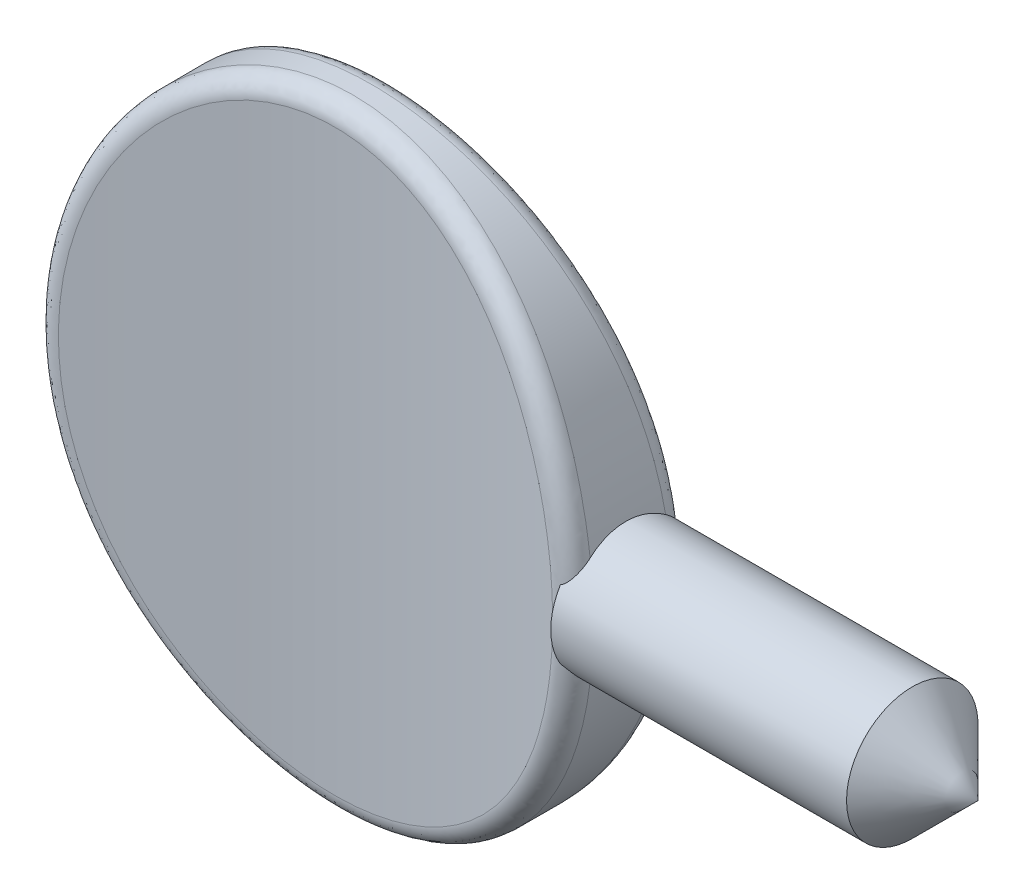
ISO-10303-21;
HEADER;
FILE_DESCRIPTION(('STEP AP214'),'2;1');
FILE_NAME('part.step','',(''),(''),'','','');
FILE_SCHEMA(('AUTOMOTIVE_DESIGN { 1 0 10303 214 1 1 1 1 }'));
ENDSEC;
DATA;
#1=APPLICATION_CONTEXT('core data for automotive mechanical design processes');
#2=APPLICATION_PROTOCOL_DEFINITION('international standard','automotive_design',2000,#1);
#3=PRODUCT_CONTEXT('',#1,'mechanical');
#4=PRODUCT('Part','Part','',(#3));
#5=PRODUCT_RELATED_PRODUCT_CATEGORY('part','',(#4));
#6=PRODUCT_DEFINITION_FORMATION('','',#4);
#7=PRODUCT_DEFINITION_CONTEXT('part definition',#1,'design');
#8=PRODUCT_DEFINITION('design','',#6,#7);
#9=PRODUCT_DEFINITION_SHAPE('','',#8);
#10=(LENGTH_UNIT() NAMED_UNIT(*) SI_UNIT(.MILLI.,.METRE.));
#11=(NAMED_UNIT(*) PLANE_ANGLE_UNIT() SI_UNIT($,.RADIAN.));
#12=(NAMED_UNIT(*) SI_UNIT($,.STERADIAN.) SOLID_ANGLE_UNIT());
#13=UNCERTAINTY_MEASURE_WITH_UNIT(LENGTH_MEASURE(1.E-05),#10,'distance_accuracy_value','');
#14=(GEOMETRIC_REPRESENTATION_CONTEXT(3) GLOBAL_UNCERTAINTY_ASSIGNED_CONTEXT((#13)) GLOBAL_UNIT_ASSIGNED_CONTEXT((#10,
#11,#12)) REPRESENTATION_CONTEXT('',''));
#15=CARTESIAN_POINT('',(0.,0.,0.));
#16=DIRECTION('',(0.,0.,1.));
#17=DIRECTION('',(1.,0.,0.));
#18=AXIS2_PLACEMENT_3D('',#15,#16,#17);
#19=CARTESIAN_POINT('',(0.,0.,2.286));
#20=DIRECTION('',(0.,0.,1.));
#21=DIRECTION('',(0.,-1.,0.));
#22=AXIS2_PLACEMENT_3D('',#19,#20,#21);
#23=ELLIPSE('',#22,11.303,9.906);
#24=DIRECTION('',(0.,0.,-1.));
#25=VECTOR('',#24,1.);
#26=SURFACE_OF_LINEAR_EXTRUSION('',#23,#25);
#27=CARTESIAN_POINT('',(9.7599834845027,-1.93354475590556,1.44359747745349));
#28=CARTESIAN_POINT('',(9.7538599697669,-1.97377990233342,1.3897162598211));
#29=CARTESIAN_POINT('',(9.74788480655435,-2.01176072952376,1.33413671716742));
#30=CARTESIAN_POINT('',(9.73639068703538,-2.08297198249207,1.21996586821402));
#31=CARTESIAN_POINT('',(9.73087174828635,-2.11620222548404,1.1613744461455));
#32=CARTESIAN_POINT('',(9.72044940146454,-2.17767139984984,1.04156116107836));
#33=CARTESIAN_POINT('',(9.71554607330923,-2.20590968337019,0.980338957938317));
#34=CARTESIAN_POINT('',(9.70649644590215,-2.25717945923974,0.855719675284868));
#35=CARTESIAN_POINT('',(9.70235011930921,-2.28021113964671,0.792322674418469));
#36=CARTESIAN_POINT('',(9.69123192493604,-2.34125083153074,0.59939431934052));
#37=CARTESIAN_POINT('',(9.68558076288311,-2.37120394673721,0.46712472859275));
#38=CARTESIAN_POINT('',(9.67850306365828,-2.40853619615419,0.199478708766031));
#39=CARTESIAN_POINT('',(9.67707378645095,-2.4159299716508,0.0641043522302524));
#40=CARTESIAN_POINT('',(9.67858617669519,-2.40802787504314,-0.204493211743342));
#41=CARTESIAN_POINT('',(9.68148053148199,-2.39297760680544,-0.337723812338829));
#42=CARTESIAN_POINT('',(9.6912194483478,-2.34108806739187,-0.599771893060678));
#43=CARTESIAN_POINT('',(9.69806554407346,-2.30424033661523,-0.728587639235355));
#44=CARTESIAN_POINT('',(9.7137074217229,-2.21664920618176,-0.960257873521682));
#45=CARTESIAN_POINT('',(9.72208273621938,-2.16865680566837,-1.06418600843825));
#46=CARTESIAN_POINT('',(9.73584734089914,-2.08614660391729,-1.21400793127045));
#47=CARTESIAN_POINT('',(9.74063407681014,-2.05690073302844,-1.26292205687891));
#48=CARTESIAN_POINT('',(9.7505120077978,-1.99503672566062,-1.35854295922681));
#49=CARTESIAN_POINT('',(9.7556032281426,-1.96241830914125,-1.40524955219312));
#50=CARTESIAN_POINT('',(9.76079800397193,-1.92818422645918,-1.45074966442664));
#51=B_SPLINE_CURVE_WITH_KNOTS('',3,(#27,#28,#29,#30,#31,#32,#33,#34,#35,#36,#37,#38,#39,#40,#41,
#42,#43,#44,#45,#46,#47,#48,#49,#50),.UNSPECIFIED.,.F.,.F.,(4,2,2,2,2,2,2,2,2,2,2,4),(0.,
0.202511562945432,0.405030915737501,0.607576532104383,0.810114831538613,1.2151884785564,
1.61999917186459,2.02041242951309,2.42098118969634,2.7640979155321,2.93554569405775,
3.10700772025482),.UNSPECIFIED.);
#52=CARTESIAN_POINT('',(9.75349384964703,-1.97571933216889,1.38531661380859));
#53=VERTEX_POINT('',#52);
#54=CARTESIAN_POINT('',(9.75349384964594,-1.97571933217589,-1.38531661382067));
#55=VERTEX_POINT('',#54);
#56=EDGE_CURVE('E64',#53,#55,#51,.T.);
#57=ORIENTED_EDGE('',*,*,#56,.F.);
#58=CARTESIAN_POINT('',(9.06433649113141,-0.441553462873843,2.07648141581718));
#59=CARTESIAN_POINT('',(9.89731087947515,-0.473374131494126,2.27409385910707));
#60=CARTESIAN_POINT('',(9.8975763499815,-0.466033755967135,1.41744012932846));
#61=CARTESIAN_POINT('',(9.04072988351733,-1.10521542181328,2.07087783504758));
#62=CARTESIAN_POINT('',(9.87118982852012,-1.18437600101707,2.26734926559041));
#63=CARTESIAN_POINT('',(9.87223120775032,-1.16650607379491,1.41173989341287));
#64=CARTESIAN_POINT('',(8.96387282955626,-1.76690913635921,2.05255322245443));
#65=CARTESIAN_POINT('',(9.78656612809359,-1.8914413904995,2.24540170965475));
#66=CARTESIAN_POINT('',(9.78972693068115,-1.86500634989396,1.39309920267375));
#67=CARTESIAN_POINT('',(8.70423897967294,-3.06740809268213,1.9926113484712));
#68=CARTESIAN_POINT('',(9.49942015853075,-3.28368426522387,2.17332598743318));
#69=CARTESIAN_POINT('',(9.5106965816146,-3.23896299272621,1.33212340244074));
#70=CARTESIAN_POINT('',(8.52144099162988,-3.70620872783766,1.95098942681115));
#71=CARTESIAN_POINT('',(9.29855203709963,-3.96503959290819,2.1236030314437));
#72=CARTESIAN_POINT('',(9.3141476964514,-3.9144147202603,1.28978355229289));
#73=CARTESIAN_POINT('',(8.0522372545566,-4.93844637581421,1.84970425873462));
#74=CARTESIAN_POINT('',(8.78113980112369,-5.28032485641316,2.00228764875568));
#75=CARTESIAN_POINT('',(8.8087223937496,-5.21927582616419,1.18675133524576));
#76=CARTESIAN_POINT('',(7.76638400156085,-5.53210522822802,1.79013749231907));
#77=CARTESIAN_POINT('',(8.46783563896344,-5.91194692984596,1.93136369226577));
#78=CARTESIAN_POINT('',(8.50044492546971,-5.84890960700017,1.12615711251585));
#79=CARTESIAN_POINT('',(7.26256698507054,-6.37458445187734,1.69306358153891));
#80=CARTESIAN_POINT('',(7.9123102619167,-6.81102173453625,1.81528163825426));
#81=CARTESIAN_POINT('',(7.95575827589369,-6.74427599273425,1.02740879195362));
#82=CARTESIAN_POINT('',(7.08198860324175,-6.64756129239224,1.65939540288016));
#83=CARTESIAN_POINT('',(7.71435000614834,-7.10090761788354,1.77525192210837));
#84=CARTESIAN_POINT('',(7.76033985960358,-7.03471301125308,0.993159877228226));
#85=CARTESIAN_POINT('',(6.69635721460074,-7.17472703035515,1.59067374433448));
#86=CARTESIAN_POINT('',(7.2916832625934,-7.66016806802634,1.69362011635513));
#87=CARTESIAN_POINT('',(7.34247562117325,-7.59625745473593,0.923252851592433));
#88=CARTESIAN_POINT('',(6.49131885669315,-7.42892702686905,1.55562110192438));
#89=CARTESIAN_POINT('',(7.06731807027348,-7.92959161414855,1.65205176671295));
#90=CARTESIAN_POINT('',(7.12004597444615,-7.86737629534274,0.88759559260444));
#91=CARTESIAN_POINT('',(6.07339660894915,-7.89779481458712,1.48797563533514));
#92=CARTESIAN_POINT('',(6.61001404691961,-8.42614113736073,1.5718945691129));
#93=CARTESIAN_POINT('',(6.66603588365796,-8.36809358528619,0.818783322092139));
#94=CARTESIAN_POINT('',(5.8621693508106,-8.11399325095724,1.45538942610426));
#95=CARTESIAN_POINT('',(6.37923621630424,-8.65490610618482,1.53333835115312));
#96=CARTESIAN_POINT('',(6.43629914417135,-8.59927776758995,0.785635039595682));
#97=CARTESIAN_POINT('',(5.420462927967,-8.52495389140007,1.39126982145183));
#98=CARTESIAN_POINT('',(5.89686229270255,-9.08924875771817,1.45756148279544));
#99=CARTESIAN_POINT('',(5.95522830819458,-9.03927334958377,0.720409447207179));
#100=CARTESIAN_POINT('',(5.18999529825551,-8.71972877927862,1.3597358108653));
#101=CARTESIAN_POINT('',(5.64541451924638,-9.2950474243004,1.42032518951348));
#102=CARTESIAN_POINT('',(5.70390714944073,-9.24809798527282,0.688331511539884));
#103=CARTESIAN_POINT('',(4.7112180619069,-9.08513182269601,1.29889201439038));
#104=CARTESIAN_POINT('',(5.12333296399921,-9.68063953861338,1.34857362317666));
#105=CARTESIAN_POINT('',(5.18108360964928,-9.64035101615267,0.626438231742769));
#106=CARTESIAN_POINT('',(4.46292238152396,-9.25577852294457,1.26958052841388));
#107=CARTESIAN_POINT('',(4.85275176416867,-9.86072624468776,1.31402128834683));
#108=CARTESIAN_POINT('',(4.9095969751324,-9.82379891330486,0.596621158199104));
#109=CARTESIAN_POINT('',(3.95012425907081,-9.5703567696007,1.21433232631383));
#110=CARTESIAN_POINT('',(4.29427737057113,-10.1922417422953,1.2489893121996));
#111=CARTESIAN_POINT('',(4.34815021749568,-10.1623803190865,0.540419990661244));
#112=CARTESIAN_POINT('',(3.68562512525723,-9.71429374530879,1.18839492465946));
#113=CARTESIAN_POINT('',(4.00630404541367,-10.3439928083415,1.21845738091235));
#114=CARTESIAN_POINT('',(4.05819386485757,-10.3175195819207,0.51403519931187));
#115=CARTESIAN_POINT('',(3.18095813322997,-9.95464296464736,1.14434912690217));
#116=CARTESIAN_POINT('',(3.45702558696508,-10.5971097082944,1.1666698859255));
#117=CARTESIAN_POINT('',(3.50428103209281,-10.5768490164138,0.469229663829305));
#118=CARTESIAN_POINT('',(2.94260311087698,-10.0548925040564,1.12565265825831));
#119=CARTESIAN_POINT('',(3.19771589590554,-10.7026948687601,1.14469031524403));
#120=CARTESIAN_POINT('',(3.2424065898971,-10.6851365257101,0.450210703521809));
#121=CARTESIAN_POINT('',(2.45745188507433,-10.2322329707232,1.09221652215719));
#122=CARTESIAN_POINT('',(2.67025548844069,-10.8892399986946,1.10543443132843));
#123=CARTESIAN_POINT('',(2.70890894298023,-10.8768424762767,0.416197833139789));
#124=CARTESIAN_POINT('',(2.21065722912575,-10.3093281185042,1.0774761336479));
#125=CARTESIAN_POINT('',(2.40189348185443,-10.9703962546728,1.08811890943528));
#126=CARTESIAN_POINT('',(2.43728752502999,-10.96026544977,0.401203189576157));
#127=CARTESIAN_POINT('',(1.71091716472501,-10.4390517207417,1.05249286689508));
#128=CARTESIAN_POINT('',(1.85884865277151,-11.1067770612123,1.05881030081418));
#129=CARTESIAN_POINT('',(1.88689681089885,-11.1007143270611,0.375788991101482));
#130=CARTESIAN_POINT('',(1.45797707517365,-10.4917005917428,1.04224623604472));
#131=CARTESIAN_POINT('',(1.58389234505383,-11.1621799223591,1.04677989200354));
#132=CARTESIAN_POINT('',(1.60813368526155,-11.1577622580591,0.365365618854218));
#133=CARTESIAN_POINT('',(0.948114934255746,-10.5716983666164,1.02661952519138));
#134=CARTESIAN_POINT('',(1.03003449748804,-11.2462512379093,1.0284575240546));
#135=CARTESIAN_POINT('',(1.04597206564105,-11.2444700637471,0.349469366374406));
#136=CARTESIAN_POINT('',(0.691193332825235,-10.5990501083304,1.02123889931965));
#137=CARTESIAN_POINT('',(0.75080259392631,-11.2750269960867,1.02214236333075));
#138=CARTESIAN_POINT('',(0.762574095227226,-11.2741330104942,0.343995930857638));
#139=CARTESIAN_POINT('',(0.209209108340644,-10.6261003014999,1.01591573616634));
#140=CARTESIAN_POINT('',(0.227293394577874,-11.3034522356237,1.01590196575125));
#141=CARTESIAN_POINT('',(0.23083451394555,-11.3034697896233,0.338580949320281));
#142=CARTESIAN_POINT('',(-0.0156831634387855,-10.6289136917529,1.0153606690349));
#143=CARTESIAN_POINT('',(-0.0170749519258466,-11.3064105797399,1.01525084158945));
#144=CARTESIAN_POINT('',(-0.0173081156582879,-11.3065216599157,0.338016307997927));
#145=CARTESIAN_POINT('',(-0.464932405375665,-10.6149527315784,1.01810993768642));
#146=CARTESIAN_POINT('',(-0.504998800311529,-11.2917412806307,1.0184735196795));
#147=CARTESIAN_POINT('',(-0.512964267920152,-11.291379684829,0.340812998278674));
#148=CARTESIAN_POINT('',(-0.689289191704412,-10.5981724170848,1.02141544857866));
#149=CARTESIAN_POINT('',(-0.748793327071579,-11.274092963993,1.02235186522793));
#150=CARTESIAN_POINT('',(-0.760477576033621,-11.2731793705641,0.344175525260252));
#151=CARTESIAN_POINT('',(-1.13556884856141,-10.5452601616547,1.0317883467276));
#152=CARTESIAN_POINT('',(-1.2335417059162,-11.2184912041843,1.03451259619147));
#153=CARTESIAN_POINT('',(-1.2526768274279,-11.2158123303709,0.354727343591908));
#154=CARTESIAN_POINT('',(-1.35749296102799,-10.5091386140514,1.03885371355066));
#155=CARTESIAN_POINT('',(-1.47472448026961,-11.1804953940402,1.04280421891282));
#156=CARTESIAN_POINT('',(-1.49736421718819,-11.1766568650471,0.361914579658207));
#157=CARTESIAN_POINT('',(-1.79749977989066,-10.4180266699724,1.05654330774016));
#158=CARTESIAN_POINT('',(-1.9527689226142,-11.0847276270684,1.06355029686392));
#159=CARTESIAN_POINT('',(-1.98226996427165,-11.0779503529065,0.379909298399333));
#160=CARTESIAN_POINT('',(-2.01558099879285,-10.3630291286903,1.06716888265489));
#161=CARTESIAN_POINT('',(-2.18983193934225,-11.0268610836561,1.07602492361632));
#162=CARTESIAN_POINT('',(-2.22248659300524,-11.0183915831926,0.390718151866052));
#163=CARTESIAN_POINT('',(-2.44049679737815,-10.2366111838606,1.09134888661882));
#164=CARTESIAN_POINT('',(-2.65162302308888,-10.8939375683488,1.10439715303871));
#165=CARTESIAN_POINT('',(-2.69022849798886,-10.8815920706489,0.415315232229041));
#166=CARTESIAN_POINT('',(-2.64747600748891,-10.1656759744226,1.10481618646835));
#167=CARTESIAN_POINT('',(-2.87668834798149,-10.8192776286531,1.12021587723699));
#168=CARTESIAN_POINT('',(-2.91792129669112,-10.8048739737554,0.429014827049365));
#169=CARTESIAN_POINT('',(-3.05512217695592,-10.0074393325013,1.13449174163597));
#170=CARTESIAN_POINT('',(-3.31994587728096,-10.6528031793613,1.15506402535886));
#171=CARTESIAN_POINT('',(-3.36602555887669,-10.6338821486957,0.459202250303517));
#172=CARTESIAN_POINT('',(-3.25578691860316,-9.92013222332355,1.15070094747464));
#173=CARTESIAN_POINT('',(-3.53825524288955,-10.5608636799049,1.17411805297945));
#174=CARTESIAN_POINT('',(-3.58643446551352,-10.5396023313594,0.47569104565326));
#175=CARTESIAN_POINT('',(-3.84654426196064,-9.63504101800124,1.20285461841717));
#176=CARTESIAN_POINT('',(-4.18237180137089,-10.2600882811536,1.2355487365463));
#177=CARTESIAN_POINT('',(-4.23476308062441,-10.2320328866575,0.528744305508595));
#178=CARTESIAN_POINT('',(-4.22571339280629,-9.41399224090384,1.24234388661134));
#179=CARTESIAN_POINT('',(-4.59539551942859,-10.0267310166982,1.28209163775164));
#180=CARTESIAN_POINT('',(-4.65012975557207,-9.99391046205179,0.568914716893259));
#181=CARTESIAN_POINT('',(-4.97579964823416,-8.89885031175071,1.3305459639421));
#182=CARTESIAN_POINT('',(-5.41315254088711,-9.48328684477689,1.38604753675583));
#183=CARTESIAN_POINT('',(-5.4703040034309,-9.44018886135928,0.658638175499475));
#184=CARTESIAN_POINT('',(-5.34372659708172,-8.60038202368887,1.37973973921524));
#185=CARTESIAN_POINT('',(-5.81438792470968,-9.16774150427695,1.44414433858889));
#186=CARTESIAN_POINT('',(-5.87171654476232,-9.11997166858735,0.708680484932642));
#187=CARTESIAN_POINT('',(-6.03184666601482,-7.95150761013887,1.4804681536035));
#188=CARTESIAN_POINT('',(-6.56597991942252,-8.48184990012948,1.56320931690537));
#189=CARTESIAN_POINT('',(-6.62102535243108,-8.42537982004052,0.811146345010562));
#190=CARTESIAN_POINT('',(-6.35201943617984,-7.60107946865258,1.53200377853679));
#191=CARTESIAN_POINT('',(-6.91576322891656,-8.11070576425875,1.62422932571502));
#192=CARTESIAN_POINT('',(-6.96889880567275,-8.05098220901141,0.863570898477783));
#193=CARTESIAN_POINT('',(-6.97998081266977,-6.80920807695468,1.63984325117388));
#194=CARTESIAN_POINT('',(-7.60405609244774,-7.27066586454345,1.75228632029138));
#195=CARTESIAN_POINT('',(-7.65003938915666,-7.20661845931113,0.973270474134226));
#196=CARTESIAN_POINT('',(-7.28060968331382,-6.36185596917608,1.69588343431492));
#197=CARTESIAN_POINT('',(-7.93313272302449,-6.79574608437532,1.81884441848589));
#198=CARTESIAN_POINT('',(-7.97537608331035,-6.73055907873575,1.03027728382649));
#199=CARTESIAN_POINT('',(-7.81370754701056,-5.42598150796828,1.8002849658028));
#200=CARTESIAN_POINT('',(-8.51893240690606,-5.80032940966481,1.94329479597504));
#201=CARTESIAN_POINT('',(-8.55143234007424,-5.73641613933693,1.13647961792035));
#202=CARTESIAN_POINT('',(-8.04612685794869,-4.93742947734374,1.84864070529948));
#203=CARTESIAN_POINT('',(-8.77401400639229,-5.2803139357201,2.00093018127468));
#204=CARTESIAN_POINT('',(-8.80209751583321,-5.21830229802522,1.18566943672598));
#205=CARTESIAN_POINT('',(-8.46579777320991,-3.86798278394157,1.93874221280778));
#206=CARTESIAN_POINT('',(-9.23695256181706,-4.13843974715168,2.10886875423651));
#207=CARTESIAN_POINT('',(-9.25424841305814,-4.08562792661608,1.27732508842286));
#208=CARTESIAN_POINT('',(-8.6437754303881,-3.28317788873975,1.97890682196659));
#209=CARTESIAN_POINT('',(-9.43263150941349,-3.5145810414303,2.15687234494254));
#210=CARTESIAN_POINT('',(-9.4456739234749,-3.46710594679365,1.31818248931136));
#211=CARTESIAN_POINT('',(-8.90988228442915,-2.09221318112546,2.03992221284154));
#212=CARTESIAN_POINT('',(-9.72684753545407,-2.24001917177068,2.2302091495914));
#213=CARTESIAN_POINT('',(-9.73173019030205,-2.20856660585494,1.38025032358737));
#214=CARTESIAN_POINT('',(-8.99807319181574,-1.48606833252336,2.06078625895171));
#215=CARTESIAN_POINT('',(-9.82401541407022,-1.59219662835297,2.25521159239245));
#216=CARTESIAN_POINT('',(-9.82642742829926,-1.56856432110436,1.40147425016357));
#217=CARTESIAN_POINT('',(-9.07155097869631,-0.448175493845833,2.07818799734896));
#218=CARTESIAN_POINT('',(-9.90531304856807,-0.480096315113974,2.27615280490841));
#219=CARTESIAN_POINT('',(-9.9053231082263,-0.472998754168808,1.41917614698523));
#220=CARTESIAN_POINT('',(-9.07960069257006,-0.0180241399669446,2.08010539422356));
#221=CARTESIAN_POINT('',(-9.91421749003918,-0.0195018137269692,2.2784597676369));
#222=CARTESIAN_POINT('',(-9.91396460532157,-0.0190320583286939,1.42112661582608));
#223=CARTESIAN_POINT('',(-9.05114135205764,0.840874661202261,2.07334832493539));
#224=CARTESIAN_POINT('',(-9.8827087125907,0.901272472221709,2.27032260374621));
#225=CARTESIAN_POINT('',(-9.88340958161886,0.887501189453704,1.41425299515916));
#226=CARTESIAN_POINT('',(-9.01462354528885,1.26962181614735,2.06467177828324));
#227=CARTESIAN_POINT('',(-9.84236732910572,1.36026082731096,2.25989703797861));
#228=CARTESIAN_POINT('',(-9.84420366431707,1.34006744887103,1.40542678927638));
#229=CARTESIAN_POINT('',(-8.90937536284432,2.0316986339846,2.0400225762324));
#230=CARTESIAN_POINT('',(-9.72583784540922,2.17696234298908,2.23022004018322));
#231=CARTESIAN_POINT('',(-9.73114985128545,2.14477756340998,1.38035241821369));
#232=CARTESIAN_POINT('',(-8.8489354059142,2.3663077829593,2.02594526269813));
#233=CARTESIAN_POINT('',(-9.65907544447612,2.53501090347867,2.21331194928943));
#234=CARTESIAN_POINT('',(-9.66621476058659,2.49821035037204,1.3660322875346));
#235=CARTESIAN_POINT('',(-8.70028670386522,3.02889346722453,1.99186677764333));
#236=CARTESIAN_POINT('',(-9.49474440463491,3.24406808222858,2.17235903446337));
#237=CARTESIAN_POINT('',(-9.50642120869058,3.19839647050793,1.33136598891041));
#238=CARTESIAN_POINT('',(-8.61207087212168,3.35686828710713,1.97186409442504));
#239=CARTESIAN_POINT('',(-9.39741618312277,3.59458478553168,2.14837201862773));
#240=CARTESIAN_POINT('',(-9.41155511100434,3.54514807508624,1.31101828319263));
#241=CARTESIAN_POINT('',(-8.40792982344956,4.00383954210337,1.92654702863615));
#242=CARTESIAN_POINT('',(-9.17207272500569,4.28589025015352,2.09402079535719));
#243=CARTESIAN_POINT('',(-9.19186339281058,4.22959703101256,1.26491955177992));
#244=CARTESIAN_POINT('',(-8.29197010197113,4.32282423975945,1.90122603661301));
#245=CARTESIAN_POINT('',(-9.04433751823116,4.62626387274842,2.06371975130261));
#246=CARTESIAN_POINT('',(-9.06700046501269,4.56728252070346,1.2391618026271));
#247=CARTESIAN_POINT('',(-8.03266921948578,4.94864016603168,1.84612445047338));
#248=CARTESIAN_POINT('',(-8.75862164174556,5.29375063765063,1.9977928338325));
#249=CARTESIAN_POINT('',(-8.7875357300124,5.23032676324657,1.18310977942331));
#250=CARTESIAN_POINT('',(-7.88933080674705,5.25547261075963,1.8163443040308));
#251=CARTESIAN_POINT('',(-8.60101160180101,5.6205680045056,1.96224124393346));
#252=CARTESIAN_POINT('',(-8.63293690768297,5.55568674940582,1.1528159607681));
#253=CARTESIAN_POINT('',(-7.5827057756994,5.84065532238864,1.75476032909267));
#254=CARTESIAN_POINT('',(-8.26377031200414,6.24355498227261,1.88874534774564));
#255=CARTESIAN_POINT('',(-8.30186425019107,6.1768129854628,1.09016973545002));
#256=CARTESIAN_POINT('',(-7.42060725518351,6.11966595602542,1.72310789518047));
#257=CARTESIAN_POINT('',(-8.08585157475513,6.54018510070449,1.85105198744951));
#258=CARTESIAN_POINT('',(-8.12668803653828,6.47325210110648,1.05797133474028));
#259=CARTESIAN_POINT('',(-7.07231803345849,6.66122664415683,1.65771330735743));
#260=CARTESIAN_POINT('',(-7.70361694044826,7.11546435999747,1.77323427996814));
#261=CARTESIAN_POINT('',(-7.74985395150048,7.04926217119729,0.991448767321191));
#262=CARTESIAN_POINT('',(-6.88614017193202,6.92378536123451,1.62397227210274));
#263=CARTESIAN_POINT('',(-7.49964582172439,7.39408379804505,1.73315517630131));
#264=CARTESIAN_POINT('',(-7.54821019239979,7.3288419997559,0.957125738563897));
#265=CARTESIAN_POINT('',(-6.49029818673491,7.42975304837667,1.55555294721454));
#266=CARTESIAN_POINT('',(-7.06608461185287,7.93046508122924,1.65196090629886));
#267=CARTESIAN_POINT('',(-7.11892134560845,7.86825729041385,0.887526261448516));
#268=CARTESIAN_POINT('',(-6.2806366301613,7.67316410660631,1.52087476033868));
#269=CARTESIAN_POINT('',(-6.83678956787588,8.1883058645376,1.6108692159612));
#270=CARTESIAN_POINT('',(-6.89127909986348,8.12809490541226,0.852249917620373));
#271=CARTESIAN_POINT('',(-5.8388607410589,8.13772708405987,1.45187677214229));
#272=CARTESIAN_POINT('',(-6.35382230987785,8.67984460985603,1.52920305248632));
#273=CARTESIAN_POINT('',(-6.41093575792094,8.624649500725,0.782061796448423));
#274=CARTESIAN_POINT('',(-5.60676139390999,8.35889366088,1.417556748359));
#275=CARTESIAN_POINT('',(-6.10038934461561,8.91374416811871,1.48862685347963));
#276=CARTESIAN_POINT('',(-6.15825138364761,8.86138170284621,0.747149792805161));
#277=CARTESIAN_POINT('',(-5.14547789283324,8.75521824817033,1.35394959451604));
#278=CARTESIAN_POINT('',(-5.59675257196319,9.33250836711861,1.41349407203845));
#279=CARTESIAN_POINT('',(-5.65531654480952,9.28616485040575,0.68244549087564));
#280=CARTESIAN_POINT('',(-4.91829844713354,8.9327643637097,1.32450134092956));
#281=CARTESIAN_POINT('',(-5.34900946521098,9.5200007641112,1.37874615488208));
#282=CARTESIAN_POINT('',(-5.40732214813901,9.47671576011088,0.652489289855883));
#283=CARTESIAN_POINT('',(-4.44814344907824,9.26490654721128,1.26802841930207));
#284=CARTESIAN_POINT('',(-4.8365814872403,9.87031362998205,1.31219664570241));
#285=CARTESIAN_POINT('',(-4.89341430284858,9.833611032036,0.595042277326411));
#286=CARTESIAN_POINT('',(-4.20517788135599,9.41951692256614,1.24100224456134));
#287=CARTESIAN_POINT('',(-4.57190339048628,10.0334050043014,1.28035681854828));
#288=CARTESIAN_POINT('',(-4.62751217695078,9.99997048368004,0.56754993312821));
#289=CARTESIAN_POINT('',(-3.7052575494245,9.7034163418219,1.1903933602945));
#290=CARTESIAN_POINT('',(-4.02765051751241,10.332475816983,1.22081747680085));
#291=CARTESIAN_POINT('',(-4.07971355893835,10.3057842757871,0.516068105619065));
#292=CARTESIAN_POINT('',(-3.44831525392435,9.83272749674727,1.16680764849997));
#293=CARTESIAN_POINT('',(-3.74797965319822,10.4687607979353,1.19306613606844));
#294=CARTESIAN_POINT('',(-3.79783131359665,10.4452621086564,0.492075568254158));
#295=CARTESIAN_POINT('',(-2.92242796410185,10.0639380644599,1.12400959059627));
#296=CARTESIAN_POINT('',(-3.17597688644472,10.7120881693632,1.14278503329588));
#297=CARTESIAN_POINT('',(-3.22025584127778,10.6948915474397,0.448539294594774));
#298=CARTESIAN_POINT('',(-2.65348535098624,10.1658428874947,1.10479638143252));
#299=CARTESIAN_POINT('',(-2.88342317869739,10.8194170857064,1.12020062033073));
#300=CARTESIAN_POINT('',(-2.92456535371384,10.8050489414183,0.428994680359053));
#301=CARTESIAN_POINT('',(-2.14710069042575,10.3272733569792,1.07404899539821));
#302=CARTESIAN_POINT('',(-2.33284413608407,10.9892348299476,1.08410380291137));
#303=CARTESIAN_POINT('',(-2.36731608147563,10.9796823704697,0.39771693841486));
#304=CARTESIAN_POINT('',(-1.91094499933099,10.3908533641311,1.06179682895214));
#305=CARTESIAN_POINT('',(-2.0761007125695,11.0561454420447,1.06971620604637));
#306=CARTESIAN_POINT('',(-2.10724644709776,11.0485217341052,0.385253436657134));
#307=CARTESIAN_POINT('',(-1.43374613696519,10.4958098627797,1.04145662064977));
#308=CARTESIAN_POINT('',(-1.55762642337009,11.1664699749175,1.04586002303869));
#309=CARTESIAN_POINT('',(-1.5814284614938,11.162210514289,0.364562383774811));
#310=CARTESIAN_POINT('',(-1.1927036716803,10.5371895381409,1.03336798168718));
#311=CARTESIAN_POINT('',(-1.295640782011,11.2100047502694,1.03636574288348));
#312=CARTESIAN_POINT('',(-1.31568093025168,11.2070633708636,0.356334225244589));
#313=CARTESIAN_POINT('',(-0.707915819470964,10.5970726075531,1.02163323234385));
#314=CARTESIAN_POINT('',(-0.769059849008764,11.2729324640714,1.02260821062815));
#315=CARTESIAN_POINT('',(-0.781028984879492,11.2719859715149,0.344397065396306));
#316=CARTESIAN_POINT('',(-0.464172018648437,10.6155887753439,1.01798464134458));
#317=CARTESIAN_POINT('',(-0.504175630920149,11.2924099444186,1.01832657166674));
#318=CARTESIAN_POINT('',(-0.512126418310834,11.2920695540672,0.340685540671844));
#319=CARTESIAN_POINT('',(0.0239742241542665,10.6294808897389,1.01524901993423));
#320=CARTESIAN_POINT('',(0.0259922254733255,11.3070062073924,1.01512004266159));
#321=CARTESIAN_POINT('',(0.0264470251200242,11.3071368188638,0.337902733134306));
#322=CARTESIAN_POINT('',(0.268376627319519,10.6248581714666,1.01616172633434));
#323=CARTESIAN_POINT('',(0.291583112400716,11.3021433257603,1.01619112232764));
#324=CARTESIAN_POINT('',(0.296117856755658,11.3021219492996,0.338831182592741));
#325=CARTESIAN_POINT('',(0.731015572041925,10.5941897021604,1.02219342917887));
#326=CARTESIAN_POINT('',(0.794042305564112,11.2699210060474,1.02326107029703));
#327=CARTESIAN_POINT('',(0.806497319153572,11.2688626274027,0.344966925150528));
#328=CARTESIAN_POINT('',(0.949402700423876,10.5703538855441,1.02687846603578));
#329=CARTESIAN_POINT('',(1.03135419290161,11.244851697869,1.02875824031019));
#330=CARTESIAN_POINT('',(1.04738130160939,11.2430144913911,0.34973277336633));
#331=CARTESIAN_POINT('',(1.38344630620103,10.5043595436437,1.03977653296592));
#332=CARTESIAN_POINT('',(1.50284665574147,11.1754967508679,1.04388124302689));
#333=CARTESIAN_POINT('',(1.52596681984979,11.1714816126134,0.362853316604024));
#334=CARTESIAN_POINT('',(1.59910191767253,10.4621953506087,1.04799065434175));
#335=CARTESIAN_POINT('',(1.73723082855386,11.1311427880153,1.053521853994));
#336=CARTESIAN_POINT('',(1.76366734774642,11.1257907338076,0.371209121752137));
#337=CARTESIAN_POINT('',(2.02606245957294,10.3600924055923,1.06772057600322));
#338=CARTESIAN_POINT('',(2.20115032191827,11.0238097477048,1.07666464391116));
#339=CARTESIAN_POINT('',(2.23402228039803,11.0152178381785,0.39127936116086));
#340=CARTESIAN_POINT('',(2.23736912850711,10.3001609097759,1.0792350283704));
#341=CARTESIAN_POINT('',(2.43086687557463,10.9607473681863,1.09018446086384));
#342=CARTESIAN_POINT('',(2.46667870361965,10.9503436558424,0.402992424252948));
#343=CARTESIAN_POINT('',(2.65441619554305,10.1632551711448,1.10525920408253));
#344=CARTESIAN_POINT('',(2.88420079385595,10.8167652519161,1.12072955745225));
#345=CARTESIAN_POINT('',(2.92555248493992,10.8022616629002,0.429465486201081));
#346=CARTESIAN_POINT('',(2.86015443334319,10.0862744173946,1.11977007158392));
#347=CARTESIAN_POINT('',(3.10796098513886,10.7357272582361,1.13777888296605));
#348=CARTESIAN_POINT('',(3.15176734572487,10.7190468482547,0.444226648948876));
#349=CARTESIAN_POINT('',(3.47229190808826,9.82882926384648,1.16766697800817));
#350=CARTESIAN_POINT('',(3.77502068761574,10.4642750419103,1.19415299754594));
#351=CARTESIAN_POINT('',(3.82428787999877,10.4410018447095,0.492949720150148));
#352=CARTESIAN_POINT('',(3.8683972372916,9.62312725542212,1.20516354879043));
#353=CARTESIAN_POINT('',(4.20637914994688,10.2471702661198,1.23832898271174));
#354=CARTESIAN_POINT('',(4.25872054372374,10.2191448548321,0.531093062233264));
#355=CARTESIAN_POINT('',(4.62459293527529,9.15366768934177,1.28740400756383));
#356=CARTESIAN_POINT('',(5.03001761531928,9.75240293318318,1.33514205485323));
#357=CARTESIAN_POINT('',(5.08654839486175,9.71393277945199,0.614752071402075));
#358=CARTESIAN_POINT('',(4.9846713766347,8.88989099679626,1.33215028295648));
#359=CARTESIAN_POINT('',(5.42252640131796,9.47370233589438,1.38794594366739));
#360=CARTESIAN_POINT('',(5.47992999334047,9.43055742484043,0.660270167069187));
#361=CARTESIAN_POINT('',(5.69889695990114,8.28317315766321,1.42989181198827));
#362=CARTESIAN_POINT('',(6.20241802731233,8.83257556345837,1.50340477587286));
#363=CARTESIAN_POINT('',(6.25876561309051,8.78017530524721,0.759697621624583));
#364=CARTESIAN_POINT('',(6.04858866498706,7.93486893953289,1.48326169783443));
#365=CARTESIAN_POINT('',(6.5841873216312,8.46389482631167,1.56654004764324));
#366=CARTESIAN_POINT('',(6.63920256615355,8.40755316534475,0.813988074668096));
#367=CARTESIAN_POINT('',(6.69355774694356,7.18955442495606,1.58930188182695));
#368=CARTESIAN_POINT('',(7.28996031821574,7.6745484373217,1.69221318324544));
#369=CARTESIAN_POINT('',(7.33958984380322,7.61192292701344,0.921857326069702));
#370=CARTESIAN_POINT('',(6.98880792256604,6.79251994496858,1.64197181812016));
#371=CARTESIAN_POINT('',(7.61298151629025,7.25337948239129,1.7547092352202));
#372=CARTESIAN_POINT('',(7.65950993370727,7.18888981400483,0.975435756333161));
#373=CARTESIAN_POINT('',(7.55852416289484,5.9035257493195,1.74907555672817));
#374=CARTESIAN_POINT('',(8.23879298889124,6.30821299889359,1.88227557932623));
#375=CARTESIAN_POINT('',(8.27589606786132,6.24338332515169,1.08438690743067));
#376=CARTESIAN_POINT('',(7.82473612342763,5.40599546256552,1.80277922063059));
#377=CARTESIAN_POINT('',(8.53065041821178,5.77912309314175,1.94620221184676));
#378=CARTESIAN_POINT('',(8.56329170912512,5.71520536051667,1.13901689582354));
#379=CARTESIAN_POINT('',(8.2814684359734,4.37513696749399,1.89847802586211));
#380=CARTESIAN_POINT('',(9.03367283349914,4.68015804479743,2.06063032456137));
#381=CARTESIAN_POINT('',(9.0557691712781,4.62251452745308,1.23636639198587));
#382=CARTESIAN_POINT('',(8.47195257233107,3.84179177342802,1.94046756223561));
#383=CARTESIAN_POINT('',(9.24305355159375,4.11150478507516,2.11078670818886));
#384=CARTESIAN_POINT('',(9.26081160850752,4.05798442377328,1.27908019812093));
#385=CARTESIAN_POINT('',(8.79277988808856,2.69157447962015,2.01267902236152));
#386=CARTESIAN_POINT('',(9.59762062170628,2.88109997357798,2.19751575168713));
#387=CARTESIAN_POINT('',(9.60591371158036,2.8417227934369,1.35253722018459));
#388=CARTESIAN_POINT('',(8.91415781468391,2.07198286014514,2.04108919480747));
#389=CARTESIAN_POINT('',(9.7312231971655,2.21931200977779,2.23152481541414));
#390=CARTESIAN_POINT('',(9.73629583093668,2.1872462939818,1.38143743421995));
#391=CARTESIAN_POINT('',(9.06115860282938,0.820487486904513,2.07565423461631));
#392=CARTESIAN_POINT('',(9.89394740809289,0.878268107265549,2.27313745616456));
#393=CARTESIAN_POINT('',(9.89417614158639,0.8659119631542,1.41659868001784));
#394=CARTESIAN_POINT('',(9.08675047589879,0.188579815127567,2.08180189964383));
#395=CARTESIAN_POINT('',(9.92214545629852,0.202610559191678,2.28050627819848));
#396=CARTESIAN_POINT('',(9.92164103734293,0.199050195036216,1.42285238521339));
#397=CARTESIAN_POINT('',(9.06433649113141,-0.441553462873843,2.07648141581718));
#398=CARTESIAN_POINT('',(9.89731087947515,-0.473374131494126,2.27409385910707));
#399=CARTESIAN_POINT('',(9.8975763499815,-0.466033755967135,1.41744012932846));
#400=(BOUNDED_SURFACE() B_SPLINE_SURFACE(3,2,((#58,#59,#60),(#61,#62,#63),(#64,#65,#66),(#67,
#68,#69),(#70,#71,#72),(#73,#74,#75),(#76,#77,#78),(#79,#80,#81),(#82,#83,#84),(#85,#86,#87),
(#88,#89,#90),(#91,#92,#93),(#94,#95,#96),(#97,#98,#99),(#100,#101,#102),(#103,#104,#105),(#106,
#107,#108),(#109,#110,#111),(#112,#113,#114),(#115,#116,#117),(#118,#119,#120),(#121,#122,#123),
(#124,#125,#126),(#127,#128,#129),(#130,#131,#132),(#133,#134,#135),(#136,#137,#138),(#139,#140,
#141),(#142,#143,#144),(#145,#146,#147),(#148,#149,#150),(#151,#152,#153),(#154,#155,#156),
(#157,#158,#159),(#160,#161,#162),(#163,#164,#165),(#166,#167,#168),(#169,#170,#171),(#172,#173,
#174),(#175,#176,#177),(#178,#179,#180),(#181,#182,#183),(#184,#185,#186),(#187,#188,#189),
(#190,#191,#192),(#193,#194,#195),(#196,#197,#198),(#199,#200,#201),(#202,#203,#204),(#205,#206,
#207),(#208,#209,#210),(#211,#212,#213),(#214,#215,#216),(#217,#218,#219),(#220,#221,#222),
(#223,#224,#225),(#226,#227,#228),(#229,#230,#231),(#232,#233,#234),(#235,#236,#237),(#238,#239,
#240),(#241,#242,#243),(#244,#245,#246),(#247,#248,#249),(#250,#251,#252),(#253,#254,#255),
(#256,#257,#258),(#259,#260,#261),(#262,#263,#264),(#265,#266,#267),(#268,#269,#270),(#271,#272,
#273),(#274,#275,#276),(#277,#278,#279),(#280,#281,#282),(#283,#284,#285),(#286,#287,#288),
(#289,#290,#291),(#292,#293,#294),(#295,#296,#297),(#298,#299,#300),(#301,#302,#303),(#304,#305,
#306),(#307,#308,#309),(#310,#311,#312),(#313,#314,#315),(#316,#317,#318),(#319,#320,#321),
(#322,#323,#324),(#325,#326,#327),(#328,#329,#330),(#331,#332,#333),(#334,#335,#336),(#337,#338,
#339),(#340,#341,#342),(#343,#344,#345),(#346,#347,#348),(#349,#350,#351),(#352,#353,#354),
(#355,#356,#357),(#358,#359,#360),(#361,#362,#363),(#364,#365,#366),(#367,#368,#369),(#370,#371,
#372),(#373,#374,#375),(#376,#377,#378),(#379,#380,#381),(#382,#383,#384),(#385,#386,#387),
(#388,#389,#390),(#391,#392,#393),(#394,#395,#396),(#397,#398,#399)),.UNSPECIFIED.,.T.,.F.,
.F.) B_SPLINE_SURFACE_WITH_KNOTS((4,2,2,2,2,2,2,2,2,2,2,2,2,2,2,2,2,2,2,2,2,2,2,2,2,2,2,2,2,2,2,
2,2,2,2,2,2,2,2,2,2,2,2,2,2,2,2,2,2,2,2,2,2,2,2,2,4),(3,3),(0.,1.99013383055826,
3.98066589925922,5.9606813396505,6.95189992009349,7.94252781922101,8.86106937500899,
9.77906414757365,10.6963494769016,11.6134481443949,12.4015093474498,13.1894268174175,
13.9766850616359,14.7638549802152,15.4493720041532,16.135097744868,16.8204553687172,
17.5060726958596,18.1731188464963,18.8403967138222,20.1739641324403,21.6123317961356,
23.0513106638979,24.6794364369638,26.3087451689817,28.1416611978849,29.9733166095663,
31.2617105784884,32.5503576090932,33.5706861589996,34.5912752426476,35.6131402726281,
36.6349027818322,37.6106807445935,38.5859405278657,39.5610938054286,40.5356002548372,
41.4132125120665,42.2902749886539,43.1665674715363,44.0426868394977,44.7880998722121,
45.5334059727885,46.2782954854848,47.0231420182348,47.6927906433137,48.3626464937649,
49.0322291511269,49.7020679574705,51.0579388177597,52.4142570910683,53.9106893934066,
55.4078673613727,57.1081651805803,58.8092751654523,60.6982549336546,62.5878457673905),(0.,1.),
.UNSPECIFIED.) GEOMETRIC_REPRESENTATION_ITEM() RATIONAL_B_SPLINE_SURFACE(((1.,0.620209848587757,
1.),(1.,0.620635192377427,1.),(1.,0.622024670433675,1.),(1.,0.626603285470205,1.),(1.,
0.629792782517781,1.),(1.,0.637645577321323,1.),(1.,0.642300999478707,1.),(1.,0.650003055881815,
1.),(1.,0.652692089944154,1.),(1.,0.658224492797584,1.),(1.,0.661067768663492,1.),(1.,
0.666601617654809,1.),(1.,0.669288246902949,1.),(1.,0.674617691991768,1.),(1.,0.677260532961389,
1.),(1.,0.682400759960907,1.),(1.,0.684898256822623,1.),(1.,0.689641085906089,1.),(1.,
0.691886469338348,1.),(1.,0.69572436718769,1.),(1.,0.697364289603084,1.),(1.,0.700310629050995,
1.),(1.,0.701617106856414,1.),(1.,0.703838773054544,1.),(1.,0.704754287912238,1.),(1.,
0.706152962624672,1.),(1.,0.706636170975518,1.),(1.,0.707114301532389,1.),(1.,0.707164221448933,
1.),(1.,0.706917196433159,1.),(1.,0.706620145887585,1.),(1.,0.705690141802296,1.),(1.,
0.705057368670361,1.),(1.,0.703478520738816,1.),(1.,0.702532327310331,1.),(1.,0.700388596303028,
1.),(1.,0.699198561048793,1.),(1.,0.69658926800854,1.),(1.,0.695169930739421,1.),(1.,
0.690628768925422,1.),(1.,0.687222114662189,1.),(1.,0.679710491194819,1.),(1.,0.675571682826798,
1.),(1.,0.667208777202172,1.),(1.,0.662984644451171,1.),(1.,0.654247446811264,1.),(1.,
0.649769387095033,1.),(1.,0.641511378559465,1.),(1.,0.637731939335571,1.),(1.,0.630738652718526,
1.),(1.,0.627654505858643,1.),(1.,0.62298655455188,1.),(1.,0.621401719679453,1.),(1.,
0.620080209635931,1.),(1.,0.619934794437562,1.),(1.,0.620447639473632,1.),(1.,0.621106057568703,
1.),(1.,0.622982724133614,1.),(1.,0.624055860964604,1.),(1.,0.62666300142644,1.),(1.,
0.628197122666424,1.),(1.,0.63168899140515,1.),(1.,0.633647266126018,1.),(1.,0.637933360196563,
1.),(1.,0.640261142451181,1.),(1.,0.645107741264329,1.),(1.,0.647613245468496,1.),(1.,
0.652827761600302,1.),(1.,0.655536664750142,1.),(1.,0.661073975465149,1.),(1.,0.663902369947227,
1.),(1.,0.669577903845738,1.),(1.,0.672425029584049,1.),(1.,0.677747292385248,1.),(1.,
0.68023126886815,1.),(1.,0.685030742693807,1.),(1.,0.687346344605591,1.),(1.,0.691712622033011,
1.),(1.,0.693763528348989,1.),(1.,0.697507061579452,1.),(1.,0.699199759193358,1.),(1.,
0.701920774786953,1.),(1.,0.703010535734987,1.),(1.,0.70482443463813,1.),(1.,0.705548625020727,
1.),(1.,0.706600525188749,1.),(1.,0.706928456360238,1.),(1.,0.707174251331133,1.),(1.,
0.707092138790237,1.),(1.,0.706550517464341,1.),(1.,0.706129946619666,1.),(1.,0.704975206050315,
1.),(1.,0.704240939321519,1.),(1.,0.702483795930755,1.),(1.,0.701461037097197,1.),(1.,
0.699159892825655,1.),(1.,0.697881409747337,1.),(1.,0.693683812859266,1.),(1.,0.690425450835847,
1.),(1.,0.683371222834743,1.),(1.,0.679575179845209,1.),(1.,0.671389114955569,1.),(1.,
0.666978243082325,1.),(1.,0.658324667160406,1.),(1.,0.654082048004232,1.),(1.,0.645543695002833,
1.),(1.,0.641318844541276,1.),(1.,0.633852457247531,1.),(1.,0.630611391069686,1.),(1.,
0.625064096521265,1.),(1.,0.622900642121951,1.),(1.,0.620271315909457,1.),(1.,0.619805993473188,
1.),(1.,0.620209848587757,1.))) REPRESENTATION_ITEM('') SURFACE());
#401=CARTESIAN_POINT('',(9.8975763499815,-0.466033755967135,1.41744012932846));
#402=CARTESIAN_POINT('',(9.87223120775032,-1.16650607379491,1.41173989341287));
#403=CARTESIAN_POINT('',(9.78972693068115,-1.86500634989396,1.39309920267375));
#404=CARTESIAN_POINT('',(9.5106965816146,-3.23896299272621,1.33212340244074));
#405=CARTESIAN_POINT('',(9.3141476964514,-3.9144147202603,1.28978355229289));
#406=CARTESIAN_POINT('',(8.8087223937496,-5.21927582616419,1.18675133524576));
#407=CARTESIAN_POINT('',(8.50044492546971,-5.84890960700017,1.12615711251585));
#408=CARTESIAN_POINT('',(7.95575827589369,-6.74427599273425,1.02740879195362));
#409=CARTESIAN_POINT('',(7.76033985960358,-7.03471301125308,0.993159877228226));
#410=CARTESIAN_POINT('',(7.34247562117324,-7.59625745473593,0.923252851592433));
#411=CARTESIAN_POINT('',(7.12004597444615,-7.86737629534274,0.88759559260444));
#412=CARTESIAN_POINT('',(6.66603588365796,-8.36809358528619,0.818783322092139));
#413=CARTESIAN_POINT('',(6.43629914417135,-8.59927776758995,0.785635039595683));
#414=CARTESIAN_POINT('',(5.95522830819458,-9.03927334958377,0.720409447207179));
#415=CARTESIAN_POINT('',(5.70390714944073,-9.24809798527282,0.688331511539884));
#416=CARTESIAN_POINT('',(5.18108360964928,-9.64035101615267,0.626438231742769));
#417=CARTESIAN_POINT('',(4.9095969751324,-9.82379891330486,0.596621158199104));
#418=CARTESIAN_POINT('',(4.34815021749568,-10.1623803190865,0.540419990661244));
#419=CARTESIAN_POINT('',(4.05819386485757,-10.3175195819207,0.51403519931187));
#420=CARTESIAN_POINT('',(3.50428103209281,-10.5768490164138,0.469229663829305));
#421=CARTESIAN_POINT('',(3.2424065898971,-10.6851365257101,0.450210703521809));
#422=CARTESIAN_POINT('',(2.70890894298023,-10.8768424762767,0.416197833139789));
#423=CARTESIAN_POINT('',(2.43728752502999,-10.96026544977,0.401203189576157));
#424=CARTESIAN_POINT('',(1.88689681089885,-11.1007143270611,0.375788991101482));
#425=CARTESIAN_POINT('',(1.60813368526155,-11.1577622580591,0.365365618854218));
#426=CARTESIAN_POINT('',(1.04597206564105,-11.2444700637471,0.349469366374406));
#427=CARTESIAN_POINT('',(0.762574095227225,-11.2741330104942,0.343995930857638));
#428=CARTESIAN_POINT('',(0.23083451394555,-11.3034697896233,0.338580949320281));
#429=CARTESIAN_POINT('',(-0.0173081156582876,-11.3065216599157,0.338016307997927));
#430=CARTESIAN_POINT('',(-0.512964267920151,-11.291379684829,0.340812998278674));
#431=CARTESIAN_POINT('',(-0.760477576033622,-11.2731793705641,0.344175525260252));
#432=CARTESIAN_POINT('',(-1.2526768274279,-11.2158123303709,0.354727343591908));
#433=CARTESIAN_POINT('',(-1.49736421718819,-11.1766568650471,0.361914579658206));
#434=CARTESIAN_POINT('',(-1.98226996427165,-11.0779503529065,0.379909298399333));
#435=CARTESIAN_POINT('',(-2.22248659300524,-11.0183915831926,0.390718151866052));
#436=CARTESIAN_POINT('',(-2.69022849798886,-10.8815920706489,0.415315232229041));
#437=CARTESIAN_POINT('',(-2.91792129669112,-10.8048739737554,0.429014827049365));
#438=CARTESIAN_POINT('',(-3.36602555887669,-10.6338821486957,0.459202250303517));
#439=CARTESIAN_POINT('',(-3.58643446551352,-10.5396023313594,0.47569104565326));
#440=CARTESIAN_POINT('',(-4.23476308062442,-10.2320328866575,0.528744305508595));
#441=CARTESIAN_POINT('',(-4.65012975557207,-9.99391046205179,0.568914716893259));
#442=CARTESIAN_POINT('',(-5.4703040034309,-9.44018886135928,0.658638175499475));
#443=CARTESIAN_POINT('',(-5.87171654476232,-9.11997166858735,0.708680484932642));
#444=CARTESIAN_POINT('',(-6.62102535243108,-8.42537982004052,0.811146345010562));
#445=CARTESIAN_POINT('',(-6.96889880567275,-8.05098220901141,0.863570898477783));
#446=CARTESIAN_POINT('',(-7.65003938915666,-7.20661845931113,0.973270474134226));
#447=CARTESIAN_POINT('',(-7.97537608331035,-6.73055907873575,1.03027728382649));
#448=CARTESIAN_POINT('',(-8.55143234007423,-5.73641613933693,1.13647961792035));
#449=CARTESIAN_POINT('',(-8.80209751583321,-5.21830229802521,1.18566943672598));
#450=CARTESIAN_POINT('',(-9.25424841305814,-4.08562792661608,1.27732508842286));
#451=CARTESIAN_POINT('',(-9.4456739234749,-3.46710594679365,1.31818248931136));
#452=CARTESIAN_POINT('',(-9.73173019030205,-2.20856660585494,1.38025032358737));
#453=CARTESIAN_POINT('',(-9.82642742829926,-1.56856432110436,1.40147425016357));
#454=CARTESIAN_POINT('',(-9.9053231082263,-0.472998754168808,1.41917614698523));
#455=CARTESIAN_POINT('',(-9.91396460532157,-0.0190320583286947,1.42112661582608));
#456=CARTESIAN_POINT('',(-9.88340958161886,0.887501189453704,1.41425299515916));
#457=CARTESIAN_POINT('',(-9.84420366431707,1.34006744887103,1.40542678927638));
#458=CARTESIAN_POINT('',(-9.73114985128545,2.14477756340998,1.38035241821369));
#459=CARTESIAN_POINT('',(-9.66621476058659,2.49821035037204,1.3660322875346));
#460=CARTESIAN_POINT('',(-9.50642120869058,3.19839647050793,1.33136598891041));
#461=CARTESIAN_POINT('',(-9.41155511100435,3.54514807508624,1.31101828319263));
#462=CARTESIAN_POINT('',(-9.19186339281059,4.22959703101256,1.26491955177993));
#463=CARTESIAN_POINT('',(-9.06700046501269,4.56728252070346,1.2391618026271));
#464=CARTESIAN_POINT('',(-8.7875357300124,5.23032676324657,1.18310977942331));
#465=CARTESIAN_POINT('',(-8.63293690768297,5.55568674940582,1.1528159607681));
#466=CARTESIAN_POINT('',(-8.30186425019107,6.1768129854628,1.09016973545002));
#467=CARTESIAN_POINT('',(-8.12668803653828,6.47325210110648,1.05797133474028));
#468=CARTESIAN_POINT('',(-7.74985395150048,7.04926217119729,0.991448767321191));
#469=CARTESIAN_POINT('',(-7.54821019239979,7.3288419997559,0.957125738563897));
#470=CARTESIAN_POINT('',(-7.11892134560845,7.86825729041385,0.887526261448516));
#471=CARTESIAN_POINT('',(-6.89127909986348,8.12809490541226,0.852249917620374));
#472=CARTESIAN_POINT('',(-6.41093575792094,8.624649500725,0.782061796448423));
#473=CARTESIAN_POINT('',(-6.15825138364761,8.86138170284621,0.747149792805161));
#474=CARTESIAN_POINT('',(-5.65531654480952,9.28616485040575,0.68244549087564));
#475=CARTESIAN_POINT('',(-5.40732214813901,9.47671576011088,0.652489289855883));
#476=CARTESIAN_POINT('',(-4.89341430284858,9.83361103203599,0.595042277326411));
#477=CARTESIAN_POINT('',(-4.62751217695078,9.99997048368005,0.56754993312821));
#478=CARTESIAN_POINT('',(-4.07971355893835,10.3057842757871,0.516068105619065));
#479=CARTESIAN_POINT('',(-3.79783131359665,10.4452621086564,0.492075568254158));
#480=CARTESIAN_POINT('',(-3.22025584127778,10.6948915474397,0.448539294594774));
#481=CARTESIAN_POINT('',(-2.92456535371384,10.8050489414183,0.428994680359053));
#482=CARTESIAN_POINT('',(-2.36731608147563,10.9796823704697,0.39771693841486));
#483=CARTESIAN_POINT('',(-2.10724644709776,11.0485217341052,0.385253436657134));
#484=CARTESIAN_POINT('',(-1.5814284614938,11.162210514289,0.364562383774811));
#485=CARTESIAN_POINT('',(-1.31568093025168,11.2070633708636,0.356334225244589));
#486=CARTESIAN_POINT('',(-0.781028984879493,11.2719859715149,0.344397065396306));
#487=CARTESIAN_POINT('',(-0.512126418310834,11.2920695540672,0.340685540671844));
#488=CARTESIAN_POINT('',(0.0264470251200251,11.3071368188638,0.337902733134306));
#489=CARTESIAN_POINT('',(0.296117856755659,11.3021219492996,0.338831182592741));
#490=CARTESIAN_POINT('',(0.806497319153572,11.2688626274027,0.344966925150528));
#491=CARTESIAN_POINT('',(1.04738130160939,11.2430144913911,0.34973277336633));
#492=CARTESIAN_POINT('',(1.52596681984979,11.1714816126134,0.362853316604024));
#493=CARTESIAN_POINT('',(1.76366734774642,11.1257907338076,0.371209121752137));
#494=CARTESIAN_POINT('',(2.23402228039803,11.0152178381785,0.39127936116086));
#495=CARTESIAN_POINT('',(2.46667870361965,10.9503436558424,0.402992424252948));
#496=CARTESIAN_POINT('',(2.92555248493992,10.8022616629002,0.429465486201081));
#497=CARTESIAN_POINT('',(3.15176734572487,10.7190468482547,0.444226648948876));
#498=CARTESIAN_POINT('',(3.82428787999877,10.4410018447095,0.492949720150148));
#499=CARTESIAN_POINT('',(4.25872054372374,10.2191448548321,0.531093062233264));
#500=CARTESIAN_POINT('',(5.08654839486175,9.71393277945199,0.614752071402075));
#501=CARTESIAN_POINT('',(5.47992999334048,9.43055742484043,0.660270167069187));
#502=CARTESIAN_POINT('',(6.25876561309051,8.78017530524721,0.759697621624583));
#503=CARTESIAN_POINT('',(6.63920256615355,8.40755316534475,0.813988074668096));
#504=CARTESIAN_POINT('',(7.33958984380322,7.61192292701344,0.921857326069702));
#505=CARTESIAN_POINT('',(7.65950993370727,7.18888981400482,0.975435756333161));
#506=CARTESIAN_POINT('',(8.27589606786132,6.24338332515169,1.08438690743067));
#507=CARTESIAN_POINT('',(8.56329170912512,5.71520536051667,1.13901689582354));
#508=CARTESIAN_POINT('',(9.0557691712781,4.62251452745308,1.23636639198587));
#509=CARTESIAN_POINT('',(9.26081160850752,4.05798442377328,1.27908019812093));
#510=CARTESIAN_POINT('',(9.60591371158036,2.8417227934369,1.35253722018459));
#511=CARTESIAN_POINT('',(9.73629583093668,2.1872462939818,1.38143743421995));
#512=CARTESIAN_POINT('',(9.89417614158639,0.8659119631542,1.41659868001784));
#513=CARTESIAN_POINT('',(9.92164103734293,0.199050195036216,1.42285238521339));
#514=CARTESIAN_POINT('',(9.8975763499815,-0.466033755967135,1.41744012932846));
#515=B_SPLINE_CURVE_WITH_KNOTS('',3,(#401,#402,#403,#404,#405,#406,#407,#408,#409,#410,#411,
#412,#413,#414,#415,#416,#417,#418,#419,#420,#421,#422,#423,#424,#425,#426,#427,#428,#429,#430,
#431,#432,#433,#434,#435,#436,#437,#438,#439,#440,#441,#442,#443,#444,#445,#446,#447,#448,#449,
#450,#451,#452,#453,#454,#455,#456,#457,#458,#459,#460,#461,#462,#463,#464,#465,#466,#467,#468,
#469,#470,#471,#472,#473,#474,#475,#476,#477,#478,#479,#480,#481,#482,#483,#484,#485,#486,#487,
#488,#489,#490,#491,#492,#493,#494,#495,#496,#497,#498,#499,#500,#501,#502,#503,#504,#505,#506,
#507,#508,#509,#510,#511,#512,#513,#514),.UNSPECIFIED.,.T.,.F.,(4,2,2,2,2,2,2,2,2,2,2,2,2,2,2,2,
2,2,2,2,2,2,2,2,2,2,2,2,2,2,2,2,2,2,2,2,2,2,2,2,2,2,2,2,2,2,2,2,2,2,2,2,2,2,2,2,4),(0.,
1.99013383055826,3.98066589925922,5.9606813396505,6.95189992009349,7.94252781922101,
8.86106937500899,9.77906414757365,10.6963494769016,11.6134481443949,12.4015093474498,
13.1894268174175,13.9766850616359,14.7638549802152,15.4493720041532,16.135097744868,
16.8204553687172,17.5060726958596,18.1731188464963,18.8403967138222,20.1739641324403,
21.6123317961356,23.0513106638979,24.6794364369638,26.3087451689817,28.1416611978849,
29.9733166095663,31.2617105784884,32.5503576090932,33.5706861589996,34.5912752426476,
35.6131402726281,36.6349027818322,37.6106807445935,38.5859405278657,39.5610938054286,
40.5356002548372,41.4132125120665,42.2902749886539,43.1665674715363,44.0426868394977,
44.7880998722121,45.5334059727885,46.2782954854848,47.0231420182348,47.6927906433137,
48.3626464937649,49.0322291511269,49.7020679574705,51.0579388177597,52.4142570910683,
53.9106893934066,55.4078673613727,57.1081651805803,58.8092751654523,60.6982549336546,
62.5878457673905),.UNSPECIFIED.);
#516=CARTESIAN_POINT('',(9.75349384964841,1.97571933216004,1.38531661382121));
#517=VERTEX_POINT('',#516);
#518=EDGE_CURVE('E256',#53,#517,#515,.T.);
#519=ORIENTED_EDGE('',*,*,#518,.T.);
#520=CARTESIAN_POINT('',(9.76079800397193,1.92818422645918,-1.45074966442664));
#521=CARTESIAN_POINT('',(9.75466083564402,1.96862478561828,-1.39700972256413));
#522=CARTESIAN_POINT('',(9.74866818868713,2.00681645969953,-1.34156289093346));
#523=CARTESIAN_POINT('',(9.73713205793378,2.07845893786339,-1.22763949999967));
#524=CARTESIAN_POINT('',(9.73158859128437,2.11190956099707,-1.16916282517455));
#525=CARTESIAN_POINT('',(9.72111072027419,2.17382793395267,-1.04955980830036));
#526=CARTESIAN_POINT('',(9.71617639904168,2.20229500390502,-0.988433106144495));
#527=CARTESIAN_POINT('',(9.70705925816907,2.2540288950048,-0.863985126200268));
#528=CARTESIAN_POINT('',(9.70287641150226,2.27729590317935,-0.800663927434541));
#529=CARTESIAN_POINT('',(9.69164180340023,2.33904942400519,-0.607932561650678));
#530=CARTESIAN_POINT('',(9.68590388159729,2.36948895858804,-0.475753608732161));
#531=CARTESIAN_POINT('',(9.67864476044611,2.40779884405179,-0.208203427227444));
#532=CARTESIAN_POINT('',(9.67712081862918,2.415683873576,-0.0728343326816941));
#533=CARTESIAN_POINT('',(9.67844824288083,2.4087488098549,0.195828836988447));
#534=CARTESIAN_POINT('',(9.68125199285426,2.39417581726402,0.329129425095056));
#535=CARTESIAN_POINT('',(9.6908229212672,2.34321884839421,0.591396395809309));
#536=CARTESIAN_POINT('',(9.69759163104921,2.30682644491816,0.720361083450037));
#537=CARTESIAN_POINT('',(9.71310527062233,2.22007436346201,0.952305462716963));
#538=CARTESIAN_POINT('',(9.72142536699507,2.17247999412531,1.05635306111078));
#539=CARTESIAN_POINT('',(9.73512043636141,2.09055582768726,1.20639792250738));
#540=CARTESIAN_POINT('',(9.73988621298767,2.06150341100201,1.25539361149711));
#541=CARTESIAN_POINT('',(9.74972707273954,2.0000218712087,1.35119196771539));
#542=CARTESIAN_POINT('',(9.75480218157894,1.96759246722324,1.39799445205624));
#543=CARTESIAN_POINT('',(9.7599834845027,1.93354475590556,1.44359747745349));
#544=B_SPLINE_CURVE_WITH_KNOTS('',3,(#520,#521,#522,#523,#524,#525,#526,#527,#528,#529,#530,
#531,#532,#533,#534,#535,#536,#537,#538,#539,#540,#541,#542,#543),.UNSPECIFIED.,.F.,.F.,(4,2,2,
2,2,2,2,2,2,2,2,4),(0.,0.202545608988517,0.405098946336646,0.607679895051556,0.810253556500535,
1.2153974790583,1.6202776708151,2.02073475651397,2.42134660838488,2.76428037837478,
2.9356366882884,3.10700726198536),.UNSPECIFIED.);
#545=CARTESIAN_POINT('',(9.7534938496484,1.97571933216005,-1.38531661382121));
#546=VERTEX_POINT('',#545);
#547=EDGE_CURVE('E226',#546,#517,#544,.T.);
#548=ORIENTED_EDGE('',*,*,#547,.F.);
#549=CARTESIAN_POINT('',(-1.05514744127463,-10.5534571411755,-1.03017853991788));
#550=CARTESIAN_POINT('',(-1.14603165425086,-11.2271225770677,-1.03262149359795));
#551=CARTESIAN_POINT('',(-1.16397039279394,-11.224700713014,-0.353089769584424));
#552=CARTESIAN_POINT('',(-0.827458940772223,-10.5847289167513,-1.02405770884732));
#553=CARTESIAN_POINT('',(-0.898900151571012,-11.2599604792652,-1.02545069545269));
#554=CARTESIAN_POINT('',(-0.91288734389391,-11.2586009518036,-0.346863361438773));
#555=CARTESIAN_POINT('',(-0.59839687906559,-10.6059151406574,-1.01988826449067));
#556=CARTESIAN_POINT('',(-0.649982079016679,-11.2822436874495,-1.0205584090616));
#557=CARTESIAN_POINT('',(-0.660203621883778,-11.2815782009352,-0.34262199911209));
#558=CARTESIAN_POINT('',(-0.139298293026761,-10.6278226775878,-1.01557639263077));
#559=CARTESIAN_POINT('',(-0.151355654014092,-11.3052620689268,-1.01550416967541));
#560=CARTESIAN_POINT('',(-0.153699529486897,-11.3053379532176,-0.338235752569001));
#561=CARTESIAN_POINT('',(0.0907381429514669,-10.6285458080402,-1.01543360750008));
#562=CARTESIAN_POINT('',(0.098607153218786,-11.3060227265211,-1.015336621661));
#563=CARTESIAN_POINT('',(0.100120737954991,-11.306122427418,-0.338090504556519));
#564=CARTESIAN_POINT('',(0.549891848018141,-10.6095191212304,-1.01917926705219));
#565=CARTESIAN_POINT('',(0.597290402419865,-11.2860311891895,-1.01972716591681));
#566=CARTESIAN_POINT('',(0.606693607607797,-11.2854867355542,-0.341900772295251));
#567=CARTESIAN_POINT('',(0.77900934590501,-10.5897747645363,-1.02306663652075));
#568=CARTESIAN_POINT('',(0.846266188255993,-11.265264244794,-1.02428849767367));
#569=CARTESIAN_POINT('',(0.859446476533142,-11.2640724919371,-0.345855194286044));
#570=CARTESIAN_POINT('',(1.23458506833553,-10.5301117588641,-1.03475074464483));
#571=CARTESIAN_POINT('',(1.34112473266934,-11.202566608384,-1.03798704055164));
#572=CARTESIAN_POINT('',(1.3618555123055,-11.1993918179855,-0.357740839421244));
#573=CARTESIAN_POINT('',(1.46104329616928,-10.4901931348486,-1.04254747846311));
#574=CARTESIAN_POINT('',(1.58724765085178,-11.1605734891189,-1.04713781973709));
#575=CARTESIAN_POINT('',(1.61151168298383,-11.1561254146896,-0.36567205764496));
#576=CARTESIAN_POINT('',(1.89781400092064,-10.3933521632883,-1.0613102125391));
#577=CARTESIAN_POINT('',(2.06176721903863,-11.0587855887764,-1.06914254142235));
#578=CARTESIAN_POINT('',(2.09277259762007,-11.051229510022,-0.384758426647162));
#579=CARTESIAN_POINT('',(2.10834995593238,-10.3374325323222,-1.0720883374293));
#580=CARTESIAN_POINT('',(2.29063019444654,-10.9999492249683,-1.08179640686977));
#581=CARTESIAN_POINT('',(2.32463692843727,-10.9906833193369,-0.395722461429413));
#582=CARTESIAN_POINT('',(2.5242000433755,-10.2086701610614,-1.09665786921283));
#583=CARTESIAN_POINT('',(2.74262098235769,-10.8645453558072,-1.11062997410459));
#584=CARTESIAN_POINT('',(2.78232026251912,-10.8513709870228,-0.420715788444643));
#585=CARTESIAN_POINT('',(2.72951248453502,-10.1358220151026,-1.11045023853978));
#586=CARTESIAN_POINT('',(2.96589578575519,-10.787866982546,-1.1268324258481));
#587=CARTESIAN_POINT('',(3.0081373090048,-10.772599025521,-0.434746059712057));
#588=CARTESIAN_POINT('',(3.33565183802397,-9.89309571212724,-1.15583886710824));
#589=CARTESIAN_POINT('',(3.62625151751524,-10.5320007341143,-1.18023774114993));
#590=CARTESIAN_POINT('',(3.67429500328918,-10.5103610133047,-0.480917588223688));
#591=CARTESIAN_POINT('',(3.72703622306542,-9.69895534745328,-1.19146279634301));
#592=CARTESIAN_POINT('',(4.05242419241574,-10.3271329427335,-1.22219882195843));
#593=CARTESIAN_POINT('',(4.10373400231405,-10.3008855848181,-0.517155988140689));
#594=CARTESIAN_POINT('',(4.49835272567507,-9.2407018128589,-1.27245583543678));
#595=CARTESIAN_POINT('',(4.89257977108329,-9.84415686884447,-1.3175379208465));
#596=CARTESIAN_POINT('',(4.94852119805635,-9.8074964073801,-0.599546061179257));
#597=CARTESIAN_POINT('',(4.87621794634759,-8.97311265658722,-1.31827865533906));
#598=CARTESIAN_POINT('',(5.30441999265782,-9.56143946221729,-1.37160445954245));
#599=CARTESIAN_POINT('',(5.36151079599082,-9.51989526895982,-0.646159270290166));
#600=CARTESIAN_POINT('',(5.58825223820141,-8.38402326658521,-1.41400152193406));
#601=CARTESIAN_POINT('',(6.08132701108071,-8.9394168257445,-1.48458433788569));
#602=CARTESIAN_POINT('',(6.13823148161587,-8.88818591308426,-0.743533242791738));
#603=CARTESIAN_POINT('',(5.92240236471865,-8.06249979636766,-1.46390332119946));
#604=CARTESIAN_POINT('',(6.44608233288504,-8.59918927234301,-1.54359752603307));
#605=CARTESIAN_POINT('',(6.50194121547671,-8.5440533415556,-0.794295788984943));
#606=CARTESIAN_POINT('',(6.58192295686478,-7.33193039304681,-1.56992130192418));
#607=CARTESIAN_POINT('',(7.16801748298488,-7.8252238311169,-1.66926254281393));
#608=CARTESIAN_POINT('',(7.21853536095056,-7.76372496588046,-0.902142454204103));
#609=CARTESIAN_POINT('',(6.90095128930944,-6.91696615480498,-1.62603296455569));
#610=CARTESIAN_POINT('',(7.5169079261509,-7.38514209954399,-1.73581381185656));
#611=CARTESIAN_POINT('',(7.56435765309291,-7.32139681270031,-0.959221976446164));
#612=CARTESIAN_POINT('',(7.47542188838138,-6.04317566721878,-1.73299531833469));
#613=CARTESIAN_POINT('',(8.14726882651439,-6.4571101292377,-1.86306687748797));
#614=CARTESIAN_POINT('',(8.18606446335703,-6.39179224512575,-1.06802930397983));
#615=CARTESIAN_POINT('',(7.73083178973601,-5.5843272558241,-1.78384332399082));
#616=CARTESIAN_POINT('',(8.42729031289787,-5.96926116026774,-1.92358334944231));
#617=CARTESIAN_POINT('',(8.46191338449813,-5.90449312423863,-1.11975437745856));
#618=CARTESIAN_POINT('',(8.20530857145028,-4.57172813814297,-1.88197004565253));
#619=CARTESIAN_POINT('',(8.94999200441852,-4.88953255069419,-2.0409222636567));
#620=CARTESIAN_POINT('',(8.97374170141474,-4.8307063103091,-1.21957366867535));
#621=CARTESIAN_POINT('',(8.41525964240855,-4.01341264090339,-1.92791319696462));
#622=CARTESIAN_POINT('',(9.18063067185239,-4.29450114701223,-2.09576685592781));
#623=CARTESIAN_POINT('',(9.19979498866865,-4.23957970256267,-1.26630928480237));
#624=CARTESIAN_POINT('',(8.74990976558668,-2.8698115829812,-2.00286808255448));
#625=CARTESIAN_POINT('',(9.55020424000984,-3.07198137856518,-2.18572071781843));
#626=CARTESIAN_POINT('',(9.5598266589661,-3.03010051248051,-1.34255705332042));
#627=CARTESIAN_POINT('',(8.87457264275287,-2.28451469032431,-2.03187263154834));
#628=CARTESIAN_POINT('',(9.68745491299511,-2.4468153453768,-2.22044506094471));
#629=CARTESIAN_POINT('',(9.6937659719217,-2.4117364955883,-1.37206189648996));
#630=CARTESIAN_POINT('',(9.04488672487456,-1.04960178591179,-2.07175851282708));
#631=CARTESIAN_POINT('',(9.87600921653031,-1.12355450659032,-2.26846461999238));
#632=CARTESIAN_POINT('',(9.87671133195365,-1.10773932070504,-1.4126357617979));
#633=CARTESIAN_POINT('',(9.08276303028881,-0.398804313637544,-2.08085341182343));
#634=CARTESIAN_POINT('',(9.91772813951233,-0.427834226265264,-2.27936294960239));
#635=CARTESIAN_POINT('',(9.9173602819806,-0.420917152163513,-1.42188753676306));
#636=CARTESIAN_POINT('',(9.05653545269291,0.900660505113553,-2.07463096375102));
#637=CARTESIAN_POINT('',(9.88867220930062,0.965332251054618,-2.27186496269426));
#638=CARTESIAN_POINT('',(9.88920057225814,0.950592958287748,-1.41555775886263));
#639=CARTESIAN_POINT('',(8.99240636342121,1.54932728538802,-2.05930758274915));
#640=CARTESIAN_POINT('',(9.81804162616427,1.65863037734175,-2.25350601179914));
#641=CARTESIAN_POINT('',(9.82036485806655,1.63528033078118,-1.39997006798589));
#642=CARTESIAN_POINT('',(8.75954173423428,2.84405845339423,-2.00526176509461));
#643=CARTESIAN_POINT('',(9.56046896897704,3.0449360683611,-2.1885061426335));
#644=CARTESIAN_POINT('',(9.57015017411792,3.00289371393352,-1.34499202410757));
#645=CARTESIAN_POINT('',(8.58803632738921,3.48958258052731,-1.96592045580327));
#646=CARTESIAN_POINT('',(9.37196331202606,3.73362718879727,-2.14149239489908));
#647=CARTESIAN_POINT('',(9.38579106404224,3.68527599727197,-1.30497212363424));
#648=CARTESIAN_POINT('',(8.13891883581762,4.74048710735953,-1.86802484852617));
#649=CARTESIAN_POINT('',(8.87651750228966,5.06933395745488,-2.02417663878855));
#650=CARTESIAN_POINT('',(8.90216108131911,5.00947042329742,-1.20538793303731));
#651=CARTESIAN_POINT('',(7.8612945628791,5.34586288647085,-1.80946834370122));
#652=CARTESIAN_POINT('',(8.57216543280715,5.71359847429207,-1.95443177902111));
#653=CARTESIAN_POINT('',(8.60287700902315,5.65127789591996,-1.14582139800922));
#654=CARTESIAN_POINT('',(7.37343049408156,6.19713295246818,-1.71413137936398));
#655=CARTESIAN_POINT('',(8.03394730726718,6.62253325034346,-1.84034941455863));
#656=CARTESIAN_POINT('',(8.0756648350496,6.55559654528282,-1.04883998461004));
#657=CARTESIAN_POINT('',(7.20232981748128,6.46734639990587,-1.68170380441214));
#658=CARTESIAN_POINT('',(7.84629426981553,6.90960356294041,-1.80177242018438));
#659=CARTESIAN_POINT('',(7.89059280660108,6.84295194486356,-1.01585307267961));
#660=CARTESIAN_POINT('',(6.83662527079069,6.99049655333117,-1.61525983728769));
#661=CARTESIAN_POINT('',(7.44528533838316,7.46486372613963,-1.72279637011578));
#662=CARTESIAN_POINT('',(7.4945377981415,7.39991406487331,-0.94826302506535));
#663=CARTESIAN_POINT('',(6.64203429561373,7.24344261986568,-1.58124432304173));
#664=CARTESIAN_POINT('',(7.23225523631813,7.73307234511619,-1.68243352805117));
#665=CARTESIAN_POINT('',(7.28356903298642,7.66953039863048,-0.913660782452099));
#666=CARTESIAN_POINT('',(6.23004598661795,7.72929380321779,-1.51279524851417));
#667=CARTESIAN_POINT('',(6.7813684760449,8.24770239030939,-1.6012945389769));
#668=CARTESIAN_POINT('',(6.83630225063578,8.18804063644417,-0.844031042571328));
#669=CARTESIAN_POINT('',(6.01264772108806,7.96219810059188,-1.47836167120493));
#670=CARTESIAN_POINT('',(6.54377156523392,8.49424413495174,-1.56053142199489));
#671=CARTESIAN_POINT('',(6.60000319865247,8.43693369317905,-0.809003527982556));
#672=CARTESIAN_POINT('',(5.55609993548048,8.40495283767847,-1.41036989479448));
#673=CARTESIAN_POINT('',(6.04501419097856,8.96236010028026,-1.48013820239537));
#674=CARTESIAN_POINT('',(6.10304968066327,8.91070139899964,-0.739838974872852));
#675=CARTESIAN_POINT('',(5.31695421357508,8.61480728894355,-1.37681154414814));
#676=CARTESIAN_POINT('',(5.78403741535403,9.18416231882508,-1.44049577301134));
#677=CARTESIAN_POINT('',(5.84239946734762,9.13558022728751,-0.70570178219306));
#678=CARTESIAN_POINT('',(4.84501644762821,8.98730709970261,-1.31539358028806));
#679=CARTESIAN_POINT('',(5.26907887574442,9.57750384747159,-1.36801261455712));
#680=CARTESIAN_POINT('',(5.32726923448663,9.53527711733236,-0.64322443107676));
#681=CARTESIAN_POINT('',(4.61427282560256,9.15260069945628,-1.28730809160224));
#682=CARTESIAN_POINT('',(5.0175712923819,9.75196563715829,-1.33489694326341));
#683=CARTESIAN_POINT('',(5.07510243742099,9.71287661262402,-0.614654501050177));
#684=CARTESIAN_POINT('',(4.13803680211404,9.46000481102,-1.2339036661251));
#685=CARTESIAN_POINT('',(4.49878219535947,10.0760110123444,-1.27201089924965));
#686=CARTESIAN_POINT('',(4.55398653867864,10.0435462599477,-0.560328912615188));
#687=CARTESIAN_POINT('',(3.89254773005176,9.60212052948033,-1.20858410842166));
#688=CARTESIAN_POINT('',(4.23145785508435,10.2258589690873,-1.24219936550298));
#689=CARTESIAN_POINT('',(4.28504122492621,10.1966219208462,-0.534572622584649));
#690=CARTESIAN_POINT('',(3.38915828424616,9.86067840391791,-1.1617139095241));
#691=CARTESIAN_POINT('',(3.68364716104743,10.4981168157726,-1.18709168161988));
#692=CARTESIAN_POINT('',(3.73289955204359,10.4754114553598,-0.48689396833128));
#693=CARTESIAN_POINT('',(3.13128737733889,9.97717815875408,-1.14015483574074));
#694=CARTESIAN_POINT('',(3.40304545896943,10.6208588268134,-1.16173670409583));
#695=CARTESIAN_POINT('',(3.44973696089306,10.6011867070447,-0.464963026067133));
#696=CARTESIAN_POINT('',(2.60501194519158,10.1828115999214,-1.10161391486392));
#697=CARTESIAN_POINT('',(2.83079419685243,10.8371991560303,-1.11647766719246));
#698=CARTESIAN_POINT('',(2.87125496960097,10.8233861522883,-0.425757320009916));
#699=CARTESIAN_POINT('',(2.33661286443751,10.2719592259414,-1.08462973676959));
#700=CARTESIAN_POINT('',(2.53889401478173,10.9310701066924,-1.09652002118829));
#701=CARTESIAN_POINT('',(2.57594184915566,10.9198252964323,-0.408480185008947));
#702=CARTESIAN_POINT('',(1.75351762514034,10.4317266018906,-1.05393866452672));
#703=CARTESIAN_POINT('',(1.90539051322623,11.0990022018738,-1.06052172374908));
#704=CARTESIAN_POINT('',(1.93386895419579,11.092768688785,-0.377259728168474));
#705=CARTESIAN_POINT('',(1.43761237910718,10.497987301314,-1.04102677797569));
#706=CARTESIAN_POINT('',(1.56188426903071,11.168774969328,-1.04535246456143));
#707=CARTESIAN_POINT('',(1.58570765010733,11.164572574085,-0.364125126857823));
#708=CARTESIAN_POINT('',(0.799976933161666,10.5909099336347,-1.02285523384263));
#709=CARTESIAN_POINT('',(0.869251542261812,11.2664235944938,-1.02404791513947));
#710=CARTESIAN_POINT('',(0.882602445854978,11.2652980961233,-0.34564014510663));
#711=CARTESIAN_POINT('',(0.478247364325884,10.6175761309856,-1.01759475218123));
#712=CARTESIAN_POINT('',(0.519471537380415,11.2944944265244,-1.01787034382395));
#713=CARTESIAN_POINT('',(0.527659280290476,11.2942243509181,-0.340288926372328));
#714=CARTESIAN_POINT('',(-0.0682323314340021,10.6286285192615,-1.01541579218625));
#715=CARTESIAN_POINT('',(-0.074077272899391,11.3061140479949,-1.01531478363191));
#716=CARTESIAN_POINT('',(-0.0752803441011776,11.3062128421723,-0.338072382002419));
#717=CARTESIAN_POINT('',(-0.29282571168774,10.6233783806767,-1.01645244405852));
#718=CARTESIAN_POINT('',(-0.318121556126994,11.3005906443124,-1.01653142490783));
#719=CARTESIAN_POINT('',(-0.323090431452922,11.3005172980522,-0.339126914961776));
#720=CARTESIAN_POINT('',(-0.74077094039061,10.5933990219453,-1.0223492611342));
#721=CARTESIAN_POINT('',(-0.804643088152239,11.2690886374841,-1.02344408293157));
#722=CARTESIAN_POINT('',(-0.817258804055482,11.2680049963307,-0.345125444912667));
#723=CARTESIAN_POINT('',(-0.964122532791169,10.5686659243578,-1.02721018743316));
#724=CARTESIAN_POINT('',(-1.04735516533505,11.2430753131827,-1.02914770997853));
#725=CARTESIAN_POINT('',(-1.06361679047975,11.2411840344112,-0.350070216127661));
#726=CARTESIAN_POINT('',(-1.40797290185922,10.5000290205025,-1.0406209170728));
#727=CARTESIAN_POINT('',(-1.52950274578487,11.1709435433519,-1.04487176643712));
#728=CARTESIAN_POINT('',(-1.55300479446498,11.1667885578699,-0.363712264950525));
#729=CARTESIAN_POINT('',(-1.62846988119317,10.4561136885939,-1.04917293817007));
#730=CARTESIAN_POINT('',(-1.7691545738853,11.124745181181,-1.0549094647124));
#731=CARTESIAN_POINT('',(-1.79603272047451,11.1192015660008,-0.372411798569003));
#732=CARTESIAN_POINT('',(-2.06499735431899,10.3496806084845,-1.0697242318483));
#733=CARTESIAN_POINT('',(-2.24348048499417,11.0128572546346,-1.07901662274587));
#734=CARTESIAN_POINT('',(-2.27689966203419,11.0039458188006,-0.393317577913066));
#735=CARTESIAN_POINT('',(-2.28102607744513,10.2871556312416,-1.0817248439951));
#736=CARTESIAN_POINT('',(-2.47834266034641,10.9470613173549,-1.0931084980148));
#737=CARTESIAN_POINT('',(-2.51473662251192,10.9362692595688,-0.405525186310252));
#738=CARTESIAN_POINT('',(-2.70630231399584,10.1445626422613,-1.10879046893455));
#739=CARTESIAN_POINT('',(-2.940626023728,10.7970950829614,-1.12487675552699));
#740=CARTESIAN_POINT('',(-2.98261418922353,10.7820524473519,-0.433057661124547));
#741=CARTESIAN_POINT('',(-2.91557245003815,10.0645621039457,-1.12384367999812));
#742=CARTESIAN_POINT('',(-3.16822720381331,10.7128744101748,-1.14256392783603));
#743=CARTESIAN_POINT('',(-3.21268095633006,10.6955847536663,-0.448370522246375));
#744=CARTESIAN_POINT('',(-3.32697756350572,9.88782172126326,-1.15664605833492));
#745=CARTESIAN_POINT('',(-3.61568460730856,10.5268818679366,-1.18109878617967));
#746=CARTESIAN_POINT('',(-3.66460101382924,10.5047311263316,-0.481738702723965));
#747=CARTESIAN_POINT('',(-3.52910987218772,9.79107569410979,-1.17439622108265));
#748=CARTESIAN_POINT('',(-3.83564814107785,10.4249715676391,-1.20197300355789));
#749=CARTESIAN_POINT('',(-3.88645123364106,10.4003385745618,-0.499795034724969));
#750=CARTESIAN_POINT('',(-4.12297450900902,9.4773073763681,-1.23102590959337));
#751=CARTESIAN_POINT('',(-4.48348010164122,10.0937677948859,-1.26872013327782));
#752=CARTESIAN_POINT('',(-4.53765466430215,10.0621093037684,-0.557401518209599));
#753=CARTESIAN_POINT('',(-4.50255503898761,9.23662516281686,-1.27331009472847));
#754=CARTESIAN_POINT('',(-4.89705844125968,9.83959706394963,-1.31858010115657));
#755=CARTESIAN_POINT('',(-4.95307930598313,9.8030804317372,-0.60041505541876));
#756=CARTESIAN_POINT('',(-5.24613439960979,8.68341029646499,-1.36608166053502));
#757=CARTESIAN_POINT('',(-5.70809530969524,9.25570405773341,-1.42799728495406));
#758=CARTESIAN_POINT('',(-5.76533314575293,9.20902345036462,-0.694786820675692));
#759=CARTESIAN_POINT('',(-5.60736689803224,8.36713314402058,-1.41692954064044));
#760=CARTESIAN_POINT('',(-6.10217437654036,8.92119275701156,-1.48808231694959));
#761=CARTESIAN_POINT('',(-6.15903102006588,8.87005476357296,-0.746511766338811));
#762=CARTESIAN_POINT('',(-6.27982385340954,7.68389509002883,-1.51989476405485));
#763=CARTESIAN_POINT('',(-6.83713312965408,8.19849091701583,-1.60990358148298));
#764=CARTESIAN_POINT('',(-6.89053765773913,8.13942313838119,-0.851253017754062));
#765=CARTESIAN_POINT('',(-6.59102678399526,7.31691249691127,-1.5720126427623));
#766=CARTESIAN_POINT('',(-7.17729182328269,7.80959795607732,-1.67165971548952));
#767=CARTESIAN_POINT('',(-7.22832236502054,7.74773764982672,-0.904269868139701));
#768=CARTESIAN_POINT('',(-7.19878870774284,6.4898519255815,-1.68009098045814));
#769=CARTESIAN_POINT('',(-7.8439726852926,6.93151886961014,-1.80014058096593));
#770=CARTESIAN_POINT('',(-7.88692312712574,6.86669460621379,-1.01421242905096));
#771=CARTESIAN_POINT('',(-7.48769138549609,6.02389479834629,-1.73561953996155));
#772=CARTESIAN_POINT('',(-8.16039077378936,6.43654326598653,-1.866144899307));
#773=CARTESIAN_POINT('',(-8.19928383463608,6.37129042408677,-1.07069879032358));
#774=CARTESIAN_POINT('',(-7.99454713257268,5.0526958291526,-1.8375361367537));
#775=CARTESIAN_POINT('',(-8.7178157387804,5.40268285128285,-1.98777071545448));
#776=CARTESIAN_POINT('',(-8.74653232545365,5.34047261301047,-1.17437332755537));
#777=CARTESIAN_POINT('',(-8.21246334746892,4.54743374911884,-1.88391942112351));
#778=CARTESIAN_POINT('',(-8.95711903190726,4.86453918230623,-2.04310040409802));
#779=CARTESIAN_POINT('',(-8.98137986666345,4.80503837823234,-1.22155666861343));
#780=CARTESIAN_POINT('',(-8.59764561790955,3.44733249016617,-1.96819545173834));
#781=CARTESIAN_POINT('',(-9.38232249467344,3.68908690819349,-2.14416090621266));
#782=CARTESIAN_POINT('',(-9.39610866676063,3.64064004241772,-1.3072863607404));
#783=CARTESIAN_POINT('',(-8.75571437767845,2.84901408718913,-2.00440498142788));
#784=CARTESIAN_POINT('',(-9.55619672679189,3.05049273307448,-2.18746631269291));
#785=CARTESIAN_POINT('',(-9.56603240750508,3.00815626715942,-1.34412046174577));
#786=CARTESIAN_POINT('',(-8.97988527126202,1.63389975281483,-2.05637282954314));
#787=CARTESIAN_POINT('',(-9.80416680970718,1.74938315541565,-2.24996981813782));
#788=CARTESIAN_POINT('',(-9.80691560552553,1.72458777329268,-1.39698469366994));
#789=CARTESIAN_POINT('',(-9.04595478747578,1.01709734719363,-2.07212389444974));
#790=CARTESIAN_POINT('',(-9.87695804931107,1.09001791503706,-2.26884611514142));
#791=CARTESIAN_POINT('',(-9.87783996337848,1.07349654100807,-1.41300744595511));
#792=CARTESIAN_POINT('',(-9.08693902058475,-0.260915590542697,-2.08184011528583));
#793=CARTESIAN_POINT('',(-9.92236571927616,-0.280155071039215,-2.28055467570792));
#794=CARTESIAN_POINT('',(-9.92184453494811,-0.275393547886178,-1.42289125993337));
#795=CARTESIAN_POINT('',(-9.05552268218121,-0.922360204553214,-2.07429232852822));
#796=CARTESIAN_POINT('',(-9.88775589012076,-0.987224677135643,-2.27150873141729));
#797=CARTESIAN_POINT('',(-9.88812906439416,-0.973428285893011,-1.41521328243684));
#798=CARTESIAN_POINT('',(-8.88779292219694,-2.2306322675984,-2.03493417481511));
#799=CARTESIAN_POINT('',(-9.70209684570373,-2.38895497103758,-2.22413159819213));
#800=CARTESIAN_POINT('',(-9.70797242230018,-2.35479910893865,-1.3751762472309));
#801=CARTESIAN_POINT('',(-8.75145635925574,-2.87745645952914,-2.00311845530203));
#802=CARTESIAN_POINT('',(-9.55212911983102,-3.07952296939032,-2.18607443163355));
#803=CARTESIAN_POINT('',(-9.56150638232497,-3.03813191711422,-1.34281174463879));
#804=CARTESIAN_POINT('',(-8.37318929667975,-4.14273870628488,-1.91859766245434));
#805=CARTESIAN_POINT('',(-9.13442329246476,-4.43197940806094,-2.0846478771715));
#806=CARTESIAN_POINT('',(-9.15451608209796,-4.37641546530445,-1.25683306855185));
#807=CARTESIAN_POINT('',(-8.13049427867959,-4.76095487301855,-1.86574160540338));
#808=CARTESIAN_POINT('',(-8.86810993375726,-5.09050265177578,-2.02161444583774));
#809=CARTESIAN_POINT('',(-8.89316597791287,-5.03112225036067,-1.20306530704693));
#810=CARTESIAN_POINT('',(-7.68929396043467,-5.64679933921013,-1.7759065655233));
#811=CARTESIAN_POINT('',(-8.38091317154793,-6.03725004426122,-1.91396265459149));
#812=CARTESIAN_POINT('',(-8.41699504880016,-5.9709578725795,-1.11168071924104));
#813=CARTESIAN_POINT('',(-7.5292365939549,-5.93534396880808,-1.74417866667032));
#814=CARTESIAN_POINT('',(-8.20517146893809,-6.34416229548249,-1.87615816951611));
#815=CARTESIAN_POINT('',(-8.24410538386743,-6.27738696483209,-1.07940555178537));
#816=CARTESIAN_POINT('',(-7.18379413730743,-6.49592262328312,-1.67829490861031));
#817=CARTESIAN_POINT('',(-7.82589963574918,-6.93991987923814,-1.79771134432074));
#818=CARTESIAN_POINT('',(-7.87052581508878,-6.87334839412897,-1.01238537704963));
#819=CARTESIAN_POINT('',(-6.99842311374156,-6.76796569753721,-1.64414040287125));
#820=CARTESIAN_POINT('',(-7.62274297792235,-7.22870652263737,-1.75712135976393));
#821=CARTESIAN_POINT('',(-7.66985135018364,-7.16288998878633,-0.977641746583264));
#822=CARTESIAN_POINT('',(-6.61415176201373,-7.27779720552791,-1.5765704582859));
#823=CARTESIAN_POINT('',(-7.20159632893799,-7.76951571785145,-1.67687453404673));
#824=CARTESIAN_POINT('',(-7.25330620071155,-7.70616908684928,-0.908906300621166));
#825=CARTESIAN_POINT('',(-6.41660621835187,-7.51665245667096,-1.54322216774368));
#826=CARTESIAN_POINT('',(-6.9854658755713,-8.02262147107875,-1.63733820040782));
#827=CARTESIAN_POINT('',(-7.03893319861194,-7.961005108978,-0.874982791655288));
#828=CARTESIAN_POINT('',(-6.00039140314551,-7.97431602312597,-1.47657961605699));
#829=CARTESIAN_POINT('',(-6.53025690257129,-8.50706696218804,-1.55841415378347));
#830=CARTESIAN_POINT('',(-6.58665603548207,-8.44988962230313,-0.80719073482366));
#831=CARTESIAN_POINT('',(-5.78173414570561,-8.19313560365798,-1.44328533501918));
#832=CARTESIAN_POINT('',(-6.29140824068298,-8.73856408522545,-1.51903037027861));
#833=CARTESIAN_POINT('',(-6.34876525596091,-8.68394979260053,-0.773322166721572));
#834=CARTESIAN_POINT('',(-5.32441820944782,-8.60794084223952,-1.37795949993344));
#835=CARTESIAN_POINT('',(-5.79209215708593,-9.17687298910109,-1.44185121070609));
#836=CARTESIAN_POINT('',(-5.85052140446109,-9.12821512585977,-0.706869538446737));
#837=CARTESIAN_POINT('',(-5.08577116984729,-8.80393963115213,-1.34592722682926));
#838=CARTESIAN_POINT('',(-5.53177037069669,-9.38393196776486,-1.40403599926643));
#839=CARTESIAN_POINT('',(-5.59018140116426,-9.33843400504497,-0.674284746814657));
#840=CARTESIAN_POINT('',(-4.58986705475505,-9.17032058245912,-1.28436509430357));
#841=CARTESIAN_POINT('',(-4.9911260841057,-9.77046994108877,-1.33145967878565));
#842=CARTESIAN_POINT('',(-5.04843094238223,-9.7318996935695,-0.611660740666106));
#843=CARTESIAN_POINT('',(-4.33261354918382,-9.34070763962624,-1.2548347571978));
#844=CARTESIAN_POINT('',(-4.71082823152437,-9.95025745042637,-1.29665718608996));
#845=CARTESIAN_POINT('',(-4.76702452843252,-9.91515165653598,-0.581621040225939));
#846=CARTESIAN_POINT('',(-3.83603957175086,-9.63265915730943,-1.20312565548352));
#847=CARTESIAN_POINT('',(-4.16989675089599,-10.2579978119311,-1.23578265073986));
#848=CARTESIAN_POINT('',(-4.22309066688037,-10.2295247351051,-0.529020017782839));
#849=CARTESIAN_POINT('',(-3.59873352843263,-9.75769084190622,-1.18049023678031));
#850=CARTESIAN_POINT('',(-3.91157079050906,-10.3897757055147,-1.20914648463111));
#851=CARTESIAN_POINT('',(-3.96286265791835,-10.3643257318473,-0.505994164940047));
#852=CARTESIAN_POINT('',(-3.11325208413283,-9.98432394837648,-1.13884840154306));
#853=CARTESIAN_POINT('',(-3.38342318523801,-10.6283328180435,-1.16021022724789));
#854=CARTESIAN_POINT('',(-3.42991805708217,-10.608896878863,-0.463634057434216));
#855=CARTESIAN_POINT('',(-2.86507879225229,-10.0859298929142,-1.1198412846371));
#856=CARTESIAN_POINT('',(-3.11344207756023,-10.7353469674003,-1.13786621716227));
#857=CARTESIAN_POINT('',(-3.15720388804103,-10.7186718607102,-0.444299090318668));
#858=CARTESIAN_POINT('',(-2.36013267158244,-10.2639776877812,-1.08617341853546));
#859=CARTESIAN_POINT('',(-2.56449967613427,-10.9226216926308,-1.09834263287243));
#860=CARTESIAN_POINT('',(-2.60182478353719,-10.9111819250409,-0.410050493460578));
#861=CARTESIAN_POINT('',(-2.10336868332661,-10.3404445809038,-1.07150834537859));
#862=CARTESIAN_POINT('',(-2.28530189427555,-11.0031186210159,-1.08111569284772));
#863=CARTESIAN_POINT('',(-2.3191700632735,-10.993943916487,-0.395132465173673));
#864=CARTESIAN_POINT('',(-1.58340546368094,-10.4669801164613,-1.04707399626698));
#865=CARTESIAN_POINT('',(-1.72031736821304,-11.1361375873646,-1.0524540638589));
#866=CARTESIAN_POINT('',(-1.74638937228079,-11.1309690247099,-0.37027665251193));
#867=CARTESIAN_POINT('',(-1.32020718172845,-10.5170526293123,-1.03730400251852));
#868=CARTESIAN_POINT('',(-1.43420978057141,-11.1888305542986,-1.04098330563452));
#869=CARTESIAN_POINT('',(-1.45626450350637,-11.1852363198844,-0.360338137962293));
#870=CARTESIAN_POINT('',(-1.05514744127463,-10.5534571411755,-1.03017853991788));
#871=CARTESIAN_POINT('',(-1.14603165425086,-11.2271225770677,-1.03262149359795));
#872=CARTESIAN_POINT('',(-1.16397039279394,-11.224700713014,-0.353089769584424));
#873=(BOUNDED_SURFACE() B_SPLINE_SURFACE(3,2,((#549,#550,#551),(#552,#553,#554),(#555,#556,
#557),(#558,#559,#560),(#561,#562,#563),(#564,#565,#566),(#567,#568,#569),(#570,#571,#572),
(#573,#574,#575),(#576,#577,#578),(#579,#580,#581),(#582,#583,#584),(#585,#586,#587),(#588,#589,
#590),(#591,#592,#593),(#594,#595,#596),(#597,#598,#599),(#600,#601,#602),(#603,#604,#605),
(#606,#607,#608),(#609,#610,#611),(#612,#613,#614),(#615,#616,#617),(#618,#619,#620),(#621,#622,
#623),(#624,#625,#626),(#627,#628,#629),(#630,#631,#632),(#633,#634,#635),(#636,#637,#638),
(#639,#640,#641),(#642,#643,#644),(#645,#646,#647),(#648,#649,#650),(#651,#652,#653),(#654,#655,
#656),(#657,#658,#659),(#660,#661,#662),(#663,#664,#665),(#666,#667,#668),(#669,#670,#671),
(#672,#673,#674),(#675,#676,#677),(#678,#679,#680),(#681,#682,#683),(#684,#685,#686),(#687,#688,
#689),(#690,#691,#692),(#693,#694,#695),(#696,#697,#698),(#699,#700,#701),(#702,#703,#704),
(#705,#706,#707),(#708,#709,#710),(#711,#712,#713),(#714,#715,#716),(#717,#718,#719),(#720,#721,
#722),(#723,#724,#725),(#726,#727,#728),(#729,#730,#731),(#732,#733,#734),(#735,#736,#737),
(#738,#739,#740),(#741,#742,#743),(#744,#745,#746),(#747,#748,#749),(#750,#751,#752),(#753,#754,
#755),(#756,#757,#758),(#759,#760,#761),(#762,#763,#764),(#765,#766,#767),(#768,#769,#770),
(#771,#772,#773),(#774,#775,#776),(#777,#778,#779),(#780,#781,#782),(#783,#784,#785),(#786,#787,
#788),(#789,#790,#791),(#792,#793,#794),(#795,#796,#797),(#798,#799,#800),(#801,#802,#803),
(#804,#805,#806),(#807,#808,#809),(#810,#811,#812),(#813,#814,#815),(#816,#817,#818),(#819,#820,
#821),(#822,#823,#824),(#825,#826,#827),(#828,#829,#830),(#831,#832,#833),(#834,#835,#836),
(#837,#838,#839),(#840,#841,#842),(#843,#844,#845),(#846,#847,#848),(#849,#850,#851),(#852,#853,
#854),(#855,#856,#857),(#858,#859,#860),(#861,#862,#863),(#864,#865,#866),(#867,#868,#869),
(#870,#871,#872)),.UNSPECIFIED.,.T.,.F.,.F.) B_SPLINE_SURFACE_WITH_KNOTS((4,2,2,2,2,2,2,2,2,2,2,
2,2,2,2,2,2,2,2,2,2,2,2,2,2,2,2,2,2,2,2,2,2,2,2,2,2,2,2,2,2,2,2,2,2,2,2,2,2,2,2,2,2,4),(3,3),
(0.,0.701136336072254,1.4022104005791,2.10309747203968,2.80398367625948,3.4680735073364,
4.13237568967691,5.45988064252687,6.86636958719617,8.27346605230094,9.85680864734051,
11.4409551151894,13.2321916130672,15.024187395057,16.9713267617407,18.918947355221,
20.9190043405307,22.919291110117,23.8875177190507,24.8552152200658,25.8229522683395,
26.7905206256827,27.6547690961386,28.5188231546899,29.3809140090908,30.2425647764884,
31.2252001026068,32.2077295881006,32.8925140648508,33.5774348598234,34.2627677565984,
34.9483672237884,35.6313649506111,36.3146153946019,37.6799031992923,39.1370432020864,
40.5948085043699,42.2494860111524,43.9050212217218,45.7589195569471,47.6134750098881,
49.5909331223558,51.5688275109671,53.5611786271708,54.5586696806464,55.5556086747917,
56.4962602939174,57.436379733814,58.375955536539,59.3153515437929,60.1326617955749,
60.9498141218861,61.7661499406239,62.5823660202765),(0.,1.),
.UNSPECIFIED.) GEOMETRIC_REPRESENTATION_ITEM() RATIONAL_B_SPLINE_SURFACE(((1.,0.705834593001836,
1.),(1.,0.706382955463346,1.),(1.,0.70675747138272,1.),(1.,0.707144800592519,1.),(1.,
0.707157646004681,1.),(1.,0.706821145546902,1.),(1.,0.706471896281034,1.),(1.,0.705424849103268,
1.),(1.,0.704727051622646,1.),(1.,0.703054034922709,1.),(1.,0.702095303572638,1.),(1.,
0.699919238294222,1.),(1.,0.698701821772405,1.),(1.,0.694715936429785,1.),(1.,0.691612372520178,
1.),(1.,0.684644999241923,1.),(1.,0.68074694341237,1.),(1.,0.672712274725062,1.),(1.,
0.668575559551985,1.),(1.,0.65989329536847,1.),(1.,0.655361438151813,1.),(1.,0.646818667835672,
1.),(1.,0.642808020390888,1.),(1.,0.635131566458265,1.),(1.,0.631579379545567,1.),(1.,
0.625814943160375,1.),(1.,0.623603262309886,1.),(1.,0.620566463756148,1.),(1.,0.619877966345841,
1.),(1.,0.620350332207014,1.),(1.,0.62151165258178,1.),(1.,0.625634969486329,1.),(1.,
0.628644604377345,1.),(1.,0.636218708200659,1.),(1.,0.640783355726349,1.),(1.,0.648326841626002,
1.),(1.,0.650908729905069,1.),(1.,0.656239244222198,1.),(1.,0.658987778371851,1.),(1.,
0.664564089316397,1.),(1.,0.667391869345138,1.),(1.,0.673023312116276,1.),(1.,0.67582697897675,
1.),(1.,0.681001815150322,1.),(1.,0.683387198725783,1.),(1.,0.687955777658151,1.),(1.,
0.690139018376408,1.),(1.,0.694206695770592,1.),(1.,0.696091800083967,1.),(1.,0.699479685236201,
1.),(1.,0.700982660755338,1.),(1.,0.703708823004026,1.),(1.,0.704863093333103,1.),(1.,
0.70649035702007,1.),(1.,0.706963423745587,1.),(1.,0.707159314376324,1.),(1.,0.70706604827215,
1.),(1.,0.706536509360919,1.),(1.,0.706100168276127,1.),(1.,0.704899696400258,1.),(1.,
0.704135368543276,1.),(1.,0.702305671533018,1.),(1.,0.701240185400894,1.),(1.,0.698848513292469,
1.),(1.,0.697523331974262,1.),(1.,0.694651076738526,1.),(1.,0.693103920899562,1.),(1.,
0.688197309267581,1.),(1.,0.684570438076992,1.),(1.,0.676717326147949,1.),(1.,0.672467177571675,
1.),(1.,0.663972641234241,1.),(1.,0.659728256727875,1.),(1.,0.651024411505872,1.),(1.,
0.64661334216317,1.),(1.,0.638594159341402,1.),(1.,0.634986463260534,1.),(1.,0.628471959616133,
1.),(1.,0.62570092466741,1.),(1.,0.62173500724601,1.),(1.,0.620540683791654,1.),(1.,
0.619803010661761,1.),(1.,0.620374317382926,1.),(1.,0.623369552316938,1.),(1.,0.625793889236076,
1.),(1.,0.632297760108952,1.),(1.,0.636389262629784,1.),(1.,0.643439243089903,1.),(1.,
0.645943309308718,1.),(1.,0.651181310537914,1.),(1.,0.653915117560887,1.),(1.,0.659367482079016,
1.),(1.,0.662078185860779,1.),(1.,0.667539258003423,1.),(1.,0.670289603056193,1.),(1.,
0.675730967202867,1.),(1.,0.67842201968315,1.),(1.,0.683636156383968,1.),(1.,0.686159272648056,
1.),(1.,0.690610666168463,1.),(1.,0.692573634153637,1.),(1.,0.696205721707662,1.),(1.,
0.697874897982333,1.),(1.,0.700845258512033,1.),(1.,0.702146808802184,1.),(1.,0.704322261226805,
1.),(1.,0.705196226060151,1.),(1.,0.705834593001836,1.))) REPRESENTATION_ITEM('') SURFACE());
#874=CARTESIAN_POINT('',(-1.16397039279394,-11.224700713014,-0.353089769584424));
#875=CARTESIAN_POINT('',(-0.912887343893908,-11.2586009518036,-0.346863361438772));
#876=CARTESIAN_POINT('',(-0.660203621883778,-11.2815782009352,-0.34262199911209));
#877=CARTESIAN_POINT('',(-0.153699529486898,-11.3053379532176,-0.338235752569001));
#878=CARTESIAN_POINT('',(0.100120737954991,-11.306122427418,-0.338090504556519));
#879=CARTESIAN_POINT('',(0.606693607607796,-11.2854867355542,-0.341900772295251));
#880=CARTESIAN_POINT('',(0.859446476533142,-11.2640724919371,-0.345855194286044));
#881=CARTESIAN_POINT('',(1.3618555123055,-11.1993918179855,-0.357740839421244));
#882=CARTESIAN_POINT('',(1.61151168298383,-11.1561254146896,-0.36567205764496));
#883=CARTESIAN_POINT('',(2.09277259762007,-11.051229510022,-0.384758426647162));
#884=CARTESIAN_POINT('',(2.32463692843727,-10.9906833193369,-0.395722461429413));
#885=CARTESIAN_POINT('',(2.78232026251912,-10.8513709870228,-0.420715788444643));
#886=CARTESIAN_POINT('',(3.0081373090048,-10.772599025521,-0.434746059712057));
#887=CARTESIAN_POINT('',(3.67429500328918,-10.5103610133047,-0.480917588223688));
#888=CARTESIAN_POINT('',(4.10373400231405,-10.3008855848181,-0.517155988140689));
#889=CARTESIAN_POINT('',(4.94852119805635,-9.8074964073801,-0.599546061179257));
#890=CARTESIAN_POINT('',(5.36151079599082,-9.51989526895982,-0.646159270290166));
#891=CARTESIAN_POINT('',(6.13823148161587,-8.88818591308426,-0.743533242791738));
#892=CARTESIAN_POINT('',(6.50194121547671,-8.5440533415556,-0.794295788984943));
#893=CARTESIAN_POINT('',(7.21853536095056,-7.76372496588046,-0.902142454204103));
#894=CARTESIAN_POINT('',(7.56435765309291,-7.32139681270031,-0.959221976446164));
#895=CARTESIAN_POINT('',(8.18606446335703,-6.39179224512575,-1.06802930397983));
#896=CARTESIAN_POINT('',(8.46191338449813,-5.90449312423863,-1.11975437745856));
#897=CARTESIAN_POINT('',(8.97374170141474,-4.8307063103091,-1.21957366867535));
#898=CARTESIAN_POINT('',(9.19979498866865,-4.23957970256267,-1.26630928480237));
#899=CARTESIAN_POINT('',(9.5598266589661,-3.03010051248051,-1.34255705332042));
#900=CARTESIAN_POINT('',(9.6937659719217,-2.4117364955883,-1.37206189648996));
#901=CARTESIAN_POINT('',(9.87671133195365,-1.10773932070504,-1.4126357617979));
#902=CARTESIAN_POINT('',(9.9173602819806,-0.420917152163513,-1.42188753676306));
#903=CARTESIAN_POINT('',(9.88920057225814,0.950592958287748,-1.41555775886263));
#904=CARTESIAN_POINT('',(9.82036485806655,1.63528033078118,-1.39997006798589));
#905=CARTESIAN_POINT('',(9.57015017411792,3.00289371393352,-1.34499202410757));
#906=CARTESIAN_POINT('',(9.38579106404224,3.68527599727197,-1.30497212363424));
#907=CARTESIAN_POINT('',(8.90216108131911,5.00947042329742,-1.20538793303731));
#908=CARTESIAN_POINT('',(8.60287700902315,5.65127789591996,-1.14582139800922));
#909=CARTESIAN_POINT('',(8.0756648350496,6.55559654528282,-1.04883998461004));
#910=CARTESIAN_POINT('',(7.89059280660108,6.84295194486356,-1.01585307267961));
#911=CARTESIAN_POINT('',(7.4945377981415,7.39991406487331,-0.94826302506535));
#912=CARTESIAN_POINT('',(7.28356903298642,7.66953039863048,-0.913660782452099));
#913=CARTESIAN_POINT('',(6.83630225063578,8.18804063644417,-0.844031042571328));
#914=CARTESIAN_POINT('',(6.60000319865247,8.43693369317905,-0.809003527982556));
#915=CARTESIAN_POINT('',(6.10304968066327,8.91070139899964,-0.739838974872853));
#916=CARTESIAN_POINT('',(5.84239946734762,9.13558022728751,-0.70570178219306));
#917=CARTESIAN_POINT('',(5.32726923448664,9.53527711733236,-0.64322443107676));
#918=CARTESIAN_POINT('',(5.07510243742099,9.71287661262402,-0.614654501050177));
#919=CARTESIAN_POINT('',(4.55398653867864,10.0435462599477,-0.560328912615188));
#920=CARTESIAN_POINT('',(4.28504122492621,10.1966219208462,-0.534572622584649));
#921=CARTESIAN_POINT('',(3.73289955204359,10.4754114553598,-0.48689396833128));
#922=CARTESIAN_POINT('',(3.44973696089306,10.6011867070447,-0.464963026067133));
#923=CARTESIAN_POINT('',(2.87125496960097,10.8233861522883,-0.425757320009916));
#924=CARTESIAN_POINT('',(2.57594184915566,10.9198252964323,-0.408480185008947));
#925=CARTESIAN_POINT('',(1.93386895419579,11.092768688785,-0.377259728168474));
#926=CARTESIAN_POINT('',(1.58570765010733,11.164572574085,-0.364125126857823));
#927=CARTESIAN_POINT('',(0.882602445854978,11.2652980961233,-0.34564014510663));
#928=CARTESIAN_POINT('',(0.527659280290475,11.2942243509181,-0.340288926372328));
#929=CARTESIAN_POINT('',(-0.0752803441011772,11.3062128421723,-0.338072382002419));
#930=CARTESIAN_POINT('',(-0.32309043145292,11.3005172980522,-0.339126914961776));
#931=CARTESIAN_POINT('',(-0.817258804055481,11.2680049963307,-0.345125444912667));
#932=CARTESIAN_POINT('',(-1.06361679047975,11.2411840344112,-0.350070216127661));
#933=CARTESIAN_POINT('',(-1.55300479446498,11.1667885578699,-0.363712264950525));
#934=CARTESIAN_POINT('',(-1.79603272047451,11.1192015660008,-0.372411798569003));
#935=CARTESIAN_POINT('',(-2.27689966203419,11.0039458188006,-0.393317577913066));
#936=CARTESIAN_POINT('',(-2.51473662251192,10.9362692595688,-0.405525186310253));
#937=CARTESIAN_POINT('',(-2.98261418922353,10.7820524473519,-0.433057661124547));
#938=CARTESIAN_POINT('',(-3.21268095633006,10.6955847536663,-0.448370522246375));
#939=CARTESIAN_POINT('',(-3.66460101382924,10.5047311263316,-0.481738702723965));
#940=CARTESIAN_POINT('',(-3.88645123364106,10.4003385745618,-0.499795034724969));
#941=CARTESIAN_POINT('',(-4.53765466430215,10.0621093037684,-0.557401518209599));
#942=CARTESIAN_POINT('',(-4.95307930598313,9.8030804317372,-0.600415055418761));
#943=CARTESIAN_POINT('',(-5.76533314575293,9.20902345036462,-0.694786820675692));
#944=CARTESIAN_POINT('',(-6.15903102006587,8.87005476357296,-0.746511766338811));
#945=CARTESIAN_POINT('',(-6.89053765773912,8.13942313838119,-0.851253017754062));
#946=CARTESIAN_POINT('',(-7.22832236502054,7.74773764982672,-0.904269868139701));
#947=CARTESIAN_POINT('',(-7.88692312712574,6.86669460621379,-1.01421242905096));
#948=CARTESIAN_POINT('',(-8.19928383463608,6.37129042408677,-1.07069879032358));
#949=CARTESIAN_POINT('',(-8.74653232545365,5.34047261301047,-1.17437332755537));
#950=CARTESIAN_POINT('',(-8.98137986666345,4.80503837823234,-1.22155666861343));
#951=CARTESIAN_POINT('',(-9.39610866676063,3.64064004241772,-1.3072863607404));
#952=CARTESIAN_POINT('',(-9.56603240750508,3.00815626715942,-1.34412046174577));
#953=CARTESIAN_POINT('',(-9.80691560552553,1.72458777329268,-1.39698469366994));
#954=CARTESIAN_POINT('',(-9.87783996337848,1.07349654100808,-1.41300744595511));
#955=CARTESIAN_POINT('',(-9.92184453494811,-0.275393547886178,-1.42289125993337));
#956=CARTESIAN_POINT('',(-9.88812906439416,-0.973428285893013,-1.41521328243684));
#957=CARTESIAN_POINT('',(-9.70797242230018,-2.35479910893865,-1.3751762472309));
#958=CARTESIAN_POINT('',(-9.56150638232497,-3.03813191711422,-1.34281174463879));
#959=CARTESIAN_POINT('',(-9.15451608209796,-4.37641546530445,-1.25683306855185));
#960=CARTESIAN_POINT('',(-8.89316597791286,-5.03112225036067,-1.20306530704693));
#961=CARTESIAN_POINT('',(-8.41699504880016,-5.9709578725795,-1.11168071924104));
#962=CARTESIAN_POINT('',(-8.24410538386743,-6.27738696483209,-1.07940555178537));
#963=CARTESIAN_POINT('',(-7.87052581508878,-6.87334839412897,-1.01238537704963));
#964=CARTESIAN_POINT('',(-7.66985135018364,-7.16288998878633,-0.977641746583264));
#965=CARTESIAN_POINT('',(-7.25330620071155,-7.70616908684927,-0.908906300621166));
#966=CARTESIAN_POINT('',(-7.03893319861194,-7.961005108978,-0.874982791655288));
#967=CARTESIAN_POINT('',(-6.58665603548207,-8.44988962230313,-0.807190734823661));
#968=CARTESIAN_POINT('',(-6.34876525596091,-8.68394979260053,-0.773322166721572));
#969=CARTESIAN_POINT('',(-5.85052140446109,-9.12821512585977,-0.706869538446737));
#970=CARTESIAN_POINT('',(-5.59018140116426,-9.33843400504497,-0.674284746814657));
#971=CARTESIAN_POINT('',(-5.04843094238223,-9.7318996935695,-0.611660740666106));
#972=CARTESIAN_POINT('',(-4.76702452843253,-9.91515165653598,-0.58162104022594));
#973=CARTESIAN_POINT('',(-4.22309066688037,-10.2295247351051,-0.529020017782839));
#974=CARTESIAN_POINT('',(-3.96286265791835,-10.3643257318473,-0.505994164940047));
#975=CARTESIAN_POINT('',(-3.42991805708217,-10.608896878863,-0.463634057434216));
#976=CARTESIAN_POINT('',(-3.15720388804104,-10.7186718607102,-0.444299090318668));
#977=CARTESIAN_POINT('',(-2.60182478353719,-10.9111819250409,-0.410050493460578));
#978=CARTESIAN_POINT('',(-2.3191700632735,-10.993943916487,-0.395132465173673));
#979=CARTESIAN_POINT('',(-1.74638937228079,-11.1309690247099,-0.37027665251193));
#980=CARTESIAN_POINT('',(-1.45626450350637,-11.1852363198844,-0.360338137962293));
#981=CARTESIAN_POINT('',(-1.16397039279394,-11.224700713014,-0.353089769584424));
#982=B_SPLINE_CURVE_WITH_KNOTS('',3,(#874,#875,#876,#877,#878,#879,#880,#881,#882,#883,#884,
#885,#886,#887,#888,#889,#890,#891,#892,#893,#894,#895,#896,#897,#898,#899,#900,#901,#902,#903,
#904,#905,#906,#907,#908,#909,#910,#911,#912,#913,#914,#915,#916,#917,#918,#919,#920,#921,#922,
#923,#924,#925,#926,#927,#928,#929,#930,#931,#932,#933,#934,#935,#936,#937,#938,#939,#940,#941,
#942,#943,#944,#945,#946,#947,#948,#949,#950,#951,#952,#953,#954,#955,#956,#957,#958,#959,#960,
#961,#962,#963,#964,#965,#966,#967,#968,#969,#970,#971,#972,#973,#974,#975,#976,#977,#978,#979,
#980,#981),.UNSPECIFIED.,.T.,.F.,(4,2,2,2,2,2,2,2,2,2,2,2,2,2,2,2,2,2,2,2,2,2,2,2,2,2,2,2,2,2,2,
2,2,2,2,2,2,2,2,2,2,2,2,2,2,2,2,2,2,2,2,2,2,4),(0.,0.701136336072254,1.4022104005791,
2.10309747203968,2.80398367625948,3.4680735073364,4.13237568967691,5.45988064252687,
6.86636958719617,8.27346605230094,9.85680864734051,11.4409551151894,13.2321916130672,
15.024187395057,16.9713267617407,18.918947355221,20.9190043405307,22.919291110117,
23.8875177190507,24.8552152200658,25.8229522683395,26.7905206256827,27.6547690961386,
28.5188231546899,29.3809140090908,30.2425647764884,31.2252001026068,32.2077295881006,
32.8925140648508,33.5774348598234,34.2627677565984,34.9483672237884,35.6313649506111,
36.3146153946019,37.6799031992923,39.1370432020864,40.5948085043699,42.2494860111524,
43.9050212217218,45.7589195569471,47.6134750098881,49.5909331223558,51.5688275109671,
53.5611786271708,54.5586696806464,55.5556086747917,56.4962602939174,57.436379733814,
58.375955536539,59.3153515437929,60.1326617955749,60.9498141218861,61.7661499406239,
62.5823660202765),.UNSPECIFIED.);
#983=EDGE_CURVE('E148',#546,#55,#982,.T.);
#984=ORIENTED_EDGE('',*,*,#983,.T.);
#985=EDGE_LOOP('',(#57,#519,#548,#984));
#986=FACE_BOUND('',#985,.T.);
#987=ADVANCED_FACE('F42',(#986),#26,.F.);
#988=CARTESIAN_POINT('',(9.33667851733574,1.25701799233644,2.05972686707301));
#989=CARTESIAN_POINT('',(9.33666252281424,1.22790294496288,2.06118290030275));
#990=CARTESIAN_POINT('',(9.33583339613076,1.19881021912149,2.0627769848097));
#991=CARTESIAN_POINT('',(9.33281404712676,1.14072190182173,2.06610935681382));
#992=CARTESIAN_POINT('',(9.33062476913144,1.11172625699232,2.06784754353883));
#993=CARTESIAN_POINT('',(9.32515473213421,1.05389910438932,2.07133528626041));
#994=CARTESIAN_POINT('',(9.32187605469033,1.0250673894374,2.0730848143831));
#995=CARTESIAN_POINT('',(9.31440285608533,0.967513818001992,2.07650395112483));
#996=CARTESIAN_POINT('',(9.31020815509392,0.938791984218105,2.07817354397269));
#997=CARTESIAN_POINT('',(9.29650093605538,0.853000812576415,2.0829270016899));
#998=CARTESIAN_POINT('',(9.2858436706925,0.796100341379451,2.08576915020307));
#999=CARTESIAN_POINT('',(9.26228458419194,0.682703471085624,2.09039016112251));
#1000=CARTESIAN_POINT('',(9.24938165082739,0.626207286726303,2.09216849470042));
#1001=CARTESIAN_POINT('',(9.22404133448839,0.522633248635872,2.09417918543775));
#1002=CARTESIAN_POINT('',(9.21186039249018,0.475496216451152,2.0946135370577));
#1003=CARTESIAN_POINT('',(9.18654207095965,0.381493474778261,2.09444670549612));
#1004=CARTESIAN_POINT('',(9.17340485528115,0.334627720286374,2.09384569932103));
#1005=CARTESIAN_POINT('',(9.13286692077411,0.194378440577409,2.09037621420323));
#1006=CARTESIAN_POINT('',(9.10434161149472,0.101349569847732,2.08584111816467));
#1007=CARTESIAN_POINT('',(9.07404387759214,0.00585800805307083,2.07878356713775));
#1008=CARTESIAN_POINT('',(9.07311349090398,0.0029287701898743,2.0785647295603));
#1009=CARTESIAN_POINT('',(9.07218228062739,0.,2.07834357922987));
#1010=B_SPLINE_CURVE_WITH_KNOTS('',3,(#988,#989,#990,#991,#992,#993,#994,#995,#996,#997,#998,
#999,#1000,#1001,#1002,#1003,#1004,#1005,#1006,#1007,#1008,#1009),.UNSPECIFIED.,.F.,.F.,(4,2,2,
2,2,2,2,2,2,2,4),(0.,0.0874211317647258,0.174781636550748,0.261976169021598,0.349187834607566,
0.522990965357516,0.696880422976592,0.842918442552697,0.988931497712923,1.28097823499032,
1.29022190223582),.UNSPECIFIED.);
#1011=CARTESIAN_POINT('',(9.07218228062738,0.,2.07834357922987));
#1012=VERTEX_POINT('',#1011);
#1013=CARTESIAN_POINT('',(9.33667851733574,1.25701799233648,2.059726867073));
#1014=VERTEX_POINT('',#1013);
#1015=EDGE_CURVE('E212',#1012,#1014,#1010,.F.);
#1016=ORIENTED_EDGE('',*,*,#1015,.T.);
#1017=CARTESIAN_POINT('',(9.33667851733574,1.25701799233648,2.059726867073));
#1018=CARTESIAN_POINT('',(9.35334675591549,1.26472685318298,2.05502410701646));
#1019=CARTESIAN_POINT('',(9.36936811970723,1.2733340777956,2.04971022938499));
#1020=CARTESIAN_POINT('',(9.40010595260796,1.29191586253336,2.03804817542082));
#1021=CARTESIAN_POINT('',(9.41482745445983,1.30188473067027,2.0317042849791));
#1022=CARTESIAN_POINT('',(9.45686658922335,1.33304005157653,2.01151135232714));
#1023=CARTESIAN_POINT('',(9.48247052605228,1.35568684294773,1.99637553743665));
#1024=CARTESIAN_POINT('',(9.5398816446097,1.41314169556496,1.95634703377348));
#1025=CARTESIAN_POINT('',(9.5696204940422,1.44899098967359,1.93005782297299));
#1026=CARTESIAN_POINT('',(9.62256347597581,1.52224346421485,1.87284135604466));
#1027=CARTESIAN_POINT('',(9.64571586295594,1.55965643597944,1.84188014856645));
#1028=CARTESIAN_POINT('',(9.68657699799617,1.63596762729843,1.77450859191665));
#1029=CARTESIAN_POINT('',(9.70400194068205,1.67485889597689,1.7379186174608));
#1030=CARTESIAN_POINT('',(9.73183611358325,1.75113462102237,1.6610289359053));
#1031=CARTESIAN_POINT('',(9.74227510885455,1.78852482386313,1.6207458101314));
#1032=CARTESIAN_POINT('',(9.75394089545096,1.85135238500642,1.5481322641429));
#1033=CARTESIAN_POINT('',(9.75687888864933,1.87732496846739,1.51653440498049));
#1034=CARTESIAN_POINT('',(9.75848190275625,1.92776455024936,1.45189445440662));
#1035=CARTESIAN_POINT('',(9.75713294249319,1.95222635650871,1.41884798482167));
#1036=CARTESIAN_POINT('',(9.75349384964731,1.9757193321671,1.38531661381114));
#1037=B_SPLINE_CURVE_WITH_KNOTS('',3,(#1017,#1018,#1019,#1020,#1021,#1022,#1023,#1024,#1025,
#1026,#1027,#1028,#1029,#1030,#1031,#1032,#1033,#1034,#1035,#1036),.UNSPECIFIED.,.F.,.F.,(4,2,2,
2,2,2,2,2,2,4),(0.,0.0567524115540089,0.113274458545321,0.224906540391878,0.384551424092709,
0.545417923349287,0.713350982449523,0.880563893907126,1.00332662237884,1.12649013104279),.UNSPECIFIED.);
#1038=EDGE_CURVE('E219',#1014,#517,#1037,.T.);
#1039=ORIENTED_EDGE('',*,*,#1038,.T.);
#1040=ORIENTED_EDGE('',*,*,#518,.F.);
#1041=CARTESIAN_POINT('',(9.75349384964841,-1.97571933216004,1.38531661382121));
#1042=CARTESIAN_POINT('',(9.75604080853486,-1.95926695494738,1.4087883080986));
#1043=CARTESIAN_POINT('',(9.75746456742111,-1.94233662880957,1.43203727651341));
#1044=CARTESIAN_POINT('',(9.75815819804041,-1.90765011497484,1.4779245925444));
#1045=CARTESIAN_POINT('',(9.75742928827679,-1.88989440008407,1.50056327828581));
#1046=CARTESIAN_POINT('',(9.7539166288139,-1.85370803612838,1.54504286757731));
#1047=CARTESIAN_POINT('',(9.75113739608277,-1.83527895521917,1.56688541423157));
#1048=CARTESIAN_POINT('',(9.74365291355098,-1.79782737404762,1.60971881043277));
#1049=CARTESIAN_POINT('',(9.73894739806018,-1.77880479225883,1.63070954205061));
#1050=CARTESIAN_POINT('',(9.72734453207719,-1.73936168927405,1.67274055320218));
#1051=CARTESIAN_POINT('',(9.72035110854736,-1.71891833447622,1.69373289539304));
#1052=CARTESIAN_POINT('',(9.70438119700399,-1.67768175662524,1.73458795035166));
#1053=CARTESIAN_POINT('',(9.69540457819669,-1.65688851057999,1.7544505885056));
#1054=CARTESIAN_POINT('',(9.67543847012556,-1.61508639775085,1.79300712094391));
#1055=CARTESIAN_POINT('',(9.66444481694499,-1.59407717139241,1.81169848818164));
#1056=CARTESIAN_POINT('',(9.64643007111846,-1.56260831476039,1.83875396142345));
#1057=CARTESIAN_POINT('',(9.64017155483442,-1.5521268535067,1.84760832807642));
#1058=CARTESIAN_POINT('',(9.63041208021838,-1.536431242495,1.86064347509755));
#1059=CARTESIAN_POINT('',(9.62709704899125,-1.53120391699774,1.86494736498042));
#1060=CARTESIAN_POINT('',(9.62200494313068,-1.52338332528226,1.87133205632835));
#1061=CARTESIAN_POINT('',(9.62028766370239,-1.52077988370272,1.87344841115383));
#1062=CARTESIAN_POINT('',(9.61686109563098,-1.51556078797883,1.87767293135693));
#1063=CARTESIAN_POINT('',(9.61515180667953,-1.51294513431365,1.87978109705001));
#1064=CARTESIAN_POINT('',(9.61221308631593,-1.50862586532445,1.88324771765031));
#1065=CARTESIAN_POINT('',(9.61101568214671,-1.50691146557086,1.88461978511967));
#1066=CARTESIAN_POINT('',(9.60863495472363,-1.50347303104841,1.88736393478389));
#1067=CARTESIAN_POINT('',(9.6074516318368,-1.50174899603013,1.8887360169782));
#1068=CARTESIAN_POINT('',(9.60387185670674,-1.49658382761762,1.89283524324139));
#1069=CARTESIAN_POINT('',(9.60144564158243,-1.49314969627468,1.89554531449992));
#1070=CARTESIAN_POINT('',(9.59408286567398,-1.48286265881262,1.90361845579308));
#1071=CARTESIAN_POINT('',(9.58906221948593,-1.47602517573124,1.90892440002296));
#1072=CARTESIAN_POINT('',(9.57363234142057,-1.45560808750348,1.92459563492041));
#1073=CARTESIAN_POINT('',(9.56285202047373,-1.44211915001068,1.93471808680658));
#1074=CARTESIAN_POINT('',(9.54031439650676,-1.41558590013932,1.95421465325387));
#1075=CARTESIAN_POINT('',(9.52856293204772,-1.40253951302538,1.96359265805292));
#1076=CARTESIAN_POINT('',(9.51011019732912,-1.38337012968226,1.97709819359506));
#1077=CARTESIAN_POINT('',(9.50382124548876,-1.37704662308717,1.98150673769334));
#1078=CARTESIAN_POINT('',(9.49416338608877,-1.36768842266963,1.98796675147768));
#1079=CARTESIAN_POINT('',(9.49090675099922,-1.36459025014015,1.99009458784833));
#1080=CARTESIAN_POINT('',(9.48597748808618,-1.35996788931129,1.99325356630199));
#1081=CARTESIAN_POINT('',(9.48432704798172,-1.35843128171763,1.99430107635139));
#1082=CARTESIAN_POINT('',(9.4818219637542,-1.35614665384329,1.99585473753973));
#1083=CARTESIAN_POINT('',(9.48098205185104,-1.35538850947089,1.99636967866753));
#1084=CARTESIAN_POINT('',(9.47932666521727,-1.35385329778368,1.99741109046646));
#1085=CARTESIAN_POINT('',(9.47851119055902,-1.35307623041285,1.99793756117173));
#1086=CARTESIAN_POINT('',(9.47640995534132,-1.35116061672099,1.99923385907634));
#1087=CARTESIAN_POINT('',(9.47509793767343,-1.35004159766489,1.99998966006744));
#1088=CARTESIAN_POINT('',(9.47250390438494,-1.34777927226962,2.00151487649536));
#1089=CARTESIAN_POINT('',(9.47122189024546,-1.34663596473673,2.00228429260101));
#1090=CARTESIAN_POINT('',(9.46734838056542,-1.3432252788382,2.00457538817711));
#1091=CARTESIAN_POINT('',(9.46472952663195,-1.34097723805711,2.00607984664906));
#1092=CARTESIAN_POINT('',(9.45681334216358,-1.33427392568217,2.01054986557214));
#1093=CARTESIAN_POINT('',(9.4514567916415,-1.32985982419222,2.01347182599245));
#1094=CARTESIAN_POINT('',(9.43511440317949,-1.31684146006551,2.02203004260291));
#1095=CARTESIAN_POINT('',(9.42384677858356,-1.30845288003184,2.02746420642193));
#1096=CARTESIAN_POINT('',(9.40041703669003,-1.29232274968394,2.03778389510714));
#1097=CARTESIAN_POINT('',(9.38824687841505,-1.2845887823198,2.04266316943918));
#1098=CARTESIAN_POINT('',(9.36307931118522,-1.27004855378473,2.05173594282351));
#1099=CARTESIAN_POINT('',(9.35007985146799,-1.26324473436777,2.05592764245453));
#1100=CARTESIAN_POINT('',(9.33667851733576,-1.25701799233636,2.05972686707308));
#1101=B_SPLINE_CURVE_WITH_KNOTS('',3,(#1041,#1042,#1043,#1044,#1045,#1046,#1047,#1048,#1049,
#1050,#1051,#1052,#1053,#1054,#1055,#1056,#1057,#1058,#1059,#1060,#1061,#1062,#1063,#1064,#1065,
#1066,#1067,#1068,#1069,#1070,#1071,#1072,#1073,#1074,#1075,#1076,#1077,#1078,#1079,#1080,#1081,
#1082,#1083,#1084,#1085,#1086,#1087,#1088,#1089,#1090,#1091,#1092,#1093,#1094,#1095,#1096,#1097,
#1098,#1099,#1100),.UNSPECIFIED.,.F.,.F.,(4,2,2,2,2,2,2,2,2,2,2,2,2,2,2,2,2,2,2,2,2,2,2,2,2,2,2,
2,2,4),(0.,0.0862918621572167,0.172534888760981,0.258588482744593,0.344653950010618,
0.434935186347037,0.525222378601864,0.61569809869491,0.660930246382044,0.683545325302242,
0.694852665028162,0.706159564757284,0.713662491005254,0.721165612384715,0.736172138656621,
0.766185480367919,0.826191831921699,0.885860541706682,0.915698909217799,0.930617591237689,
0.938076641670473,0.941805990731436,0.945535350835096,0.951181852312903,0.956828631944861,
0.96812268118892,0.990712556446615,1.03585201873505,1.08145799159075,1.12718147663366),.UNSPECIFIED.);
#1102=CARTESIAN_POINT('',(9.33667851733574,-1.25701799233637,2.05972686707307));
#1103=VERTEX_POINT('',#1102);
#1104=EDGE_CURVE('E232',#53,#1103,#1101,.T.);
#1105=ORIENTED_EDGE('',*,*,#1104,.T.);
#1106=CARTESIAN_POINT('',(9.33667851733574,-1.25701799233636,2.05972686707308));
#1107=CARTESIAN_POINT('',(9.33666150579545,-1.2279017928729,2.06116594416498));
#1108=CARTESIAN_POINT('',(9.33583151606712,-1.19880855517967,2.06275413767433));
#1109=CARTESIAN_POINT('',(9.33281083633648,-1.14071986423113,2.06608456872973));
#1110=CARTESIAN_POINT('',(9.3306210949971,-1.11172435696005,2.06782669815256));
#1111=CARTESIAN_POINT('',(9.32515064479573,-1.05389767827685,2.07131987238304));
#1112=CARTESIAN_POINT('',(9.32187203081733,-1.02506629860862,2.07307089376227));
#1113=CARTESIAN_POINT('',(9.31439909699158,-0.967513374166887,2.07649338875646));
#1114=CARTESIAN_POINT('',(9.31020459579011,-0.938791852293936,2.07816484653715));
#1115=CARTESIAN_POINT('',(9.29650002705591,-0.853000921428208,2.08292526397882));
#1116=CARTESIAN_POINT('',(9.28584727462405,-0.796099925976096,2.08577386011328));
#1117=CARTESIAN_POINT('',(9.26228675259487,-0.682703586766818,2.09039426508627));
#1118=CARTESIAN_POINT('',(9.24937785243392,-0.626208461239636,2.09216553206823));
#1119=CARTESIAN_POINT('',(9.22404448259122,-0.522632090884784,2.09418167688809));
#1120=CARTESIAN_POINT('',(9.21187357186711,-0.475492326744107,2.09462559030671));
#1121=CARTESIAN_POINT('',(9.18656775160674,-0.381485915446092,2.09446676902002));
#1122=CARTESIAN_POINT('',(9.17343301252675,-0.334619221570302,2.09386421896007));
#1123=CARTESIAN_POINT('',(9.13288923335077,-0.194371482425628,2.09038661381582));
#1124=CARTESIAN_POINT('',(9.10434236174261,-0.101349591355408,2.08584144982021));
#1125=CARTESIAN_POINT('',(9.07404385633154,-0.00585801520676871,2.07878355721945));
#1126=CARTESIAN_POINT('',(9.07311346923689,-0.00292877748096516,2.0785647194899));
#1127=CARTESIAN_POINT('',(9.07218228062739,0.,2.07834357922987));
#1128=B_SPLINE_CURVE_WITH_KNOTS('',3,(#1106,#1107,#1108,#1109,#1110,#1111,#1112,#1113,#1114,
#1115,#1116,#1117,#1118,#1119,#1120,#1121,#1122,#1123,#1124,#1125,#1126,#1127),.UNSPECIFIED.,
.F.,.F.,(4,2,2,2,2,2,2,2,2,2,4),(0.,0.0874218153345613,0.174782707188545,0.261976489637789,
0.349187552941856,0.522990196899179,0.696880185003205,0.842919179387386,0.988932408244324,
1.28097992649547,1.29022359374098),.UNSPECIFIED.);
#1129=EDGE_CURVE('E136',#1103,#1012,#1128,.T.);
#1130=ORIENTED_EDGE('',*,*,#1129,.T.);
#1131=CARTESIAN_POINT('',(9.06433649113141,-0.441553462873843,2.07648141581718));
#1132=CARTESIAN_POINT('',(9.08675047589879,0.188579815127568,2.08180189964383));
#1133=CARTESIAN_POINT('',(9.06115860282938,0.820487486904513,2.07565423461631));
#1134=CARTESIAN_POINT('',(8.91415781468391,2.07198286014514,2.04108919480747));
#1135=CARTESIAN_POINT('',(8.79277988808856,2.69157447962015,2.01267902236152));
#1136=CARTESIAN_POINT('',(8.47195257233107,3.84179177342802,1.94046756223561));
#1137=CARTESIAN_POINT('',(8.2814684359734,4.37513696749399,1.89847802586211));
#1138=CARTESIAN_POINT('',(7.82473612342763,5.40599546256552,1.80277922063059));
#1139=CARTESIAN_POINT('',(7.55852416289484,5.9035257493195,1.74907555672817));
#1140=CARTESIAN_POINT('',(6.98880792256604,6.79251994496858,1.64197181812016));
#1141=CARTESIAN_POINT('',(6.69355774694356,7.18955442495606,1.58930188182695));
#1142=CARTESIAN_POINT('',(6.04858866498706,7.93486893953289,1.48326169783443));
#1143=CARTESIAN_POINT('',(5.69889695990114,8.28317315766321,1.42989181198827));
#1144=CARTESIAN_POINT('',(4.9846713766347,8.88989099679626,1.33215028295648));
#1145=CARTESIAN_POINT('',(4.62459293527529,9.15366768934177,1.28740400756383));
#1146=CARTESIAN_POINT('',(3.8683972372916,9.62312725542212,1.20516354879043));
#1147=CARTESIAN_POINT('',(3.47229190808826,9.82882926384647,1.16766697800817));
#1148=CARTESIAN_POINT('',(2.86015443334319,10.0862744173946,1.11977007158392));
#1149=CARTESIAN_POINT('',(2.65441619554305,10.1632551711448,1.10525920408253));
#1150=CARTESIAN_POINT('',(2.23736912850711,10.3001609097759,1.0792350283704));
#1151=CARTESIAN_POINT('',(2.02606245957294,10.3600924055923,1.06772057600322));
#1152=CARTESIAN_POINT('',(1.59910191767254,10.4621953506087,1.04799065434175));
#1153=CARTESIAN_POINT('',(1.38344630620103,10.5043595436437,1.03977653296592));
#1154=CARTESIAN_POINT('',(0.949402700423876,10.5703538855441,1.02687846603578));
#1155=CARTESIAN_POINT('',(0.731015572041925,10.5941897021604,1.02219342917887));
#1156=CARTESIAN_POINT('',(0.26837662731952,10.6248581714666,1.01616172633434));
#1157=CARTESIAN_POINT('',(0.0239742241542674,10.6294808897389,1.01524901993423));
#1158=CARTESIAN_POINT('',(-0.464172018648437,10.6155887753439,1.01798464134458));
#1159=CARTESIAN_POINT('',(-0.707915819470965,10.5970726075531,1.02163323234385));
#1160=CARTESIAN_POINT('',(-1.1927036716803,10.5371895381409,1.03336798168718));
#1161=CARTESIAN_POINT('',(-1.43374613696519,10.4958098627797,1.04145662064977));
#1162=CARTESIAN_POINT('',(-1.91094499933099,10.3908533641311,1.06179682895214));
#1163=CARTESIAN_POINT('',(-2.14710069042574,10.3272733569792,1.07404899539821));
#1164=CARTESIAN_POINT('',(-2.65348535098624,10.1658428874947,1.10479638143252));
#1165=CARTESIAN_POINT('',(-2.92242796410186,10.0639380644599,1.12400959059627));
#1166=CARTESIAN_POINT('',(-3.44831525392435,9.83272749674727,1.16680764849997));
#1167=CARTESIAN_POINT('',(-3.7052575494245,9.7034163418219,1.1903933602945));
#1168=CARTESIAN_POINT('',(-4.20517788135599,9.41951692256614,1.24100224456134));
#1169=CARTESIAN_POINT('',(-4.44814344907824,9.26490654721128,1.26802841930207));
#1170=CARTESIAN_POINT('',(-4.91829844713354,8.9327643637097,1.32450134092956));
#1171=CARTESIAN_POINT('',(-5.14547789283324,8.75521824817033,1.35394959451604));
#1172=CARTESIAN_POINT('',(-5.60676139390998,8.35889366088,1.417556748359));
#1173=CARTESIAN_POINT('',(-5.8388607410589,8.13772708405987,1.45187677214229));
#1174=CARTESIAN_POINT('',(-6.2806366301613,7.67316410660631,1.52087476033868));
#1175=CARTESIAN_POINT('',(-6.49029818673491,7.42975304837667,1.55555294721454));
#1176=CARTESIAN_POINT('',(-6.88614017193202,6.92378536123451,1.62397227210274));
#1177=CARTESIAN_POINT('',(-7.07231803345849,6.66122664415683,1.65771330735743));
#1178=CARTESIAN_POINT('',(-7.42060725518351,6.11966595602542,1.72310789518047));
#1179=CARTESIAN_POINT('',(-7.5827057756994,5.84065532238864,1.75476032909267));
#1180=CARTESIAN_POINT('',(-7.88933080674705,5.25547261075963,1.8163443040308));
#1181=CARTESIAN_POINT('',(-8.03266921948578,4.94864016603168,1.84612445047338));
#1182=CARTESIAN_POINT('',(-8.29197010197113,4.32282423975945,1.90122603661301));
#1183=CARTESIAN_POINT('',(-8.40792982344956,4.00383954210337,1.92654702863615));
#1184=CARTESIAN_POINT('',(-8.61207087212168,3.35686828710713,1.97186409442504));
#1185=CARTESIAN_POINT('',(-8.70028670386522,3.02889346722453,1.99186677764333));
#1186=CARTESIAN_POINT('',(-8.8489354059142,2.3663077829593,2.02594526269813));
#1187=CARTESIAN_POINT('',(-8.90937536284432,2.0316986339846,2.0400225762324));
#1188=CARTESIAN_POINT('',(-9.01462354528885,1.26962181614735,2.06467177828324));
#1189=CARTESIAN_POINT('',(-9.05114135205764,0.840874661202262,2.07334832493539));
#1190=CARTESIAN_POINT('',(-9.07960069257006,-0.0180241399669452,2.08010539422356));
#1191=CARTESIAN_POINT('',(-9.07155097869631,-0.448175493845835,2.07818799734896));
#1192=CARTESIAN_POINT('',(-8.99807319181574,-1.48606833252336,2.06078625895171));
#1193=CARTESIAN_POINT('',(-8.90988228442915,-2.09221318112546,2.03992221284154));
#1194=CARTESIAN_POINT('',(-8.6437754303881,-3.28317788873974,1.97890682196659));
#1195=CARTESIAN_POINT('',(-8.46579777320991,-3.86798278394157,1.93874221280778));
#1196=CARTESIAN_POINT('',(-8.04612685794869,-4.93742947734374,1.84864070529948));
#1197=CARTESIAN_POINT('',(-7.81370754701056,-5.42598150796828,1.8002849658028));
#1198=CARTESIAN_POINT('',(-7.28060968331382,-6.36185596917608,1.69588343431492));
#1199=CARTESIAN_POINT('',(-6.97998081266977,-6.80920807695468,1.63984325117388));
#1200=CARTESIAN_POINT('',(-6.35201943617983,-7.60107946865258,1.53200377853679));
#1201=CARTESIAN_POINT('',(-6.03184666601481,-7.95150761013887,1.4804681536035));
#1202=CARTESIAN_POINT('',(-5.34372659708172,-8.60038202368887,1.37973973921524));
#1203=CARTESIAN_POINT('',(-4.97579964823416,-8.89885031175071,1.3305459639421));
#1204=CARTESIAN_POINT('',(-4.22571339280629,-9.41399224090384,1.24234388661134));
#1205=CARTESIAN_POINT('',(-3.84654426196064,-9.63504101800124,1.20285461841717));
#1206=CARTESIAN_POINT('',(-3.25578691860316,-9.92013222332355,1.15070094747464));
#1207=CARTESIAN_POINT('',(-3.05512217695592,-10.0074393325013,1.13449174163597));
#1208=CARTESIAN_POINT('',(-2.64747600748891,-10.1656759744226,1.10481618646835));
#1209=CARTESIAN_POINT('',(-2.44049679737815,-10.2366111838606,1.09134888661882));
#1210=CARTESIAN_POINT('',(-2.01558099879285,-10.3630291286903,1.06716888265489));
#1211=CARTESIAN_POINT('',(-1.79749977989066,-10.4180266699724,1.05654330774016));
#1212=CARTESIAN_POINT('',(-1.35749296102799,-10.5091386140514,1.03885371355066));
#1213=CARTESIAN_POINT('',(-1.13556884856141,-10.5452601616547,1.0317883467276));
#1214=CARTESIAN_POINT('',(-0.689289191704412,-10.5981724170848,1.02141544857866));
#1215=CARTESIAN_POINT('',(-0.464932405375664,-10.6149527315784,1.01810993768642));
#1216=CARTESIAN_POINT('',(-0.0156831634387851,-10.6289136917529,1.0153606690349));
#1217=CARTESIAN_POINT('',(0.209209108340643,-10.6261003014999,1.01591573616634));
#1218=CARTESIAN_POINT('',(0.691193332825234,-10.5990501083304,1.02123889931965));
#1219=CARTESIAN_POINT('',(0.948114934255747,-10.5716983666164,1.02661952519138));
#1220=CARTESIAN_POINT('',(1.45797707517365,-10.4917005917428,1.04224623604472));
#1221=CARTESIAN_POINT('',(1.71091716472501,-10.4390517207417,1.05249286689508));
#1222=CARTESIAN_POINT('',(2.21065722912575,-10.3093281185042,1.0774761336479));
#1223=CARTESIAN_POINT('',(2.45745188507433,-10.2322329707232,1.09221652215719));
#1224=CARTESIAN_POINT('',(2.94260311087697,-10.0548925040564,1.12565265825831));
#1225=CARTESIAN_POINT('',(3.18095813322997,-9.95464296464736,1.14434912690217));
#1226=CARTESIAN_POINT('',(3.68562512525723,-9.71429374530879,1.18839492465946));
#1227=CARTESIAN_POINT('',(3.95012425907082,-9.5703567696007,1.21433232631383));
#1228=CARTESIAN_POINT('',(4.46292238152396,-9.25577852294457,1.26958052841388));
#1229=CARTESIAN_POINT('',(4.7112180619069,-9.08513182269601,1.29889201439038));
#1230=CARTESIAN_POINT('',(5.18999529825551,-8.71972877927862,1.3597358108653));
#1231=CARTESIAN_POINT('',(5.42046292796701,-8.52495389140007,1.39126982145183));
#1232=CARTESIAN_POINT('',(5.8621693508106,-8.11399325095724,1.45538942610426));
#1233=CARTESIAN_POINT('',(6.07339660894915,-7.89779481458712,1.48797563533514));
#1234=CARTESIAN_POINT('',(6.49131885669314,-7.42892702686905,1.55562110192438));
#1235=CARTESIAN_POINT('',(6.69635721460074,-7.17472703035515,1.59067374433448));
#1236=CARTESIAN_POINT('',(7.08198860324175,-6.64756129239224,1.65939540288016));
#1237=CARTESIAN_POINT('',(7.26256698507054,-6.37458445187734,1.69306358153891));
#1238=CARTESIAN_POINT('',(7.76638400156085,-5.53210522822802,1.79013749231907));
#1239=CARTESIAN_POINT('',(8.0522372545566,-4.93844637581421,1.84970425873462));
#1240=CARTESIAN_POINT('',(8.52144099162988,-3.70620872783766,1.95098942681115));
#1241=CARTESIAN_POINT('',(8.70423897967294,-3.06740809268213,1.9926113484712));
#1242=CARTESIAN_POINT('',(8.96387282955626,-1.76690913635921,2.05255322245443));
#1243=CARTESIAN_POINT('',(9.04072988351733,-1.10521542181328,2.07087783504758));
#1244=CARTESIAN_POINT('',(9.06433649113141,-0.441553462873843,2.07648141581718));
#1245=B_SPLINE_CURVE_WITH_KNOTS('',3,(#1131,#1132,#1133,#1134,#1135,#1136,#1137,#1138,#1139,
#1140,#1141,#1142,#1143,#1144,#1145,#1146,#1147,#1148,#1149,#1150,#1151,#1152,#1153,#1154,#1155,
#1156,#1157,#1158,#1159,#1160,#1161,#1162,#1163,#1164,#1165,#1166,#1167,#1168,#1169,#1170,#1171,
#1172,#1173,#1174,#1175,#1176,#1177,#1178,#1179,#1180,#1181,#1182,#1183,#1184,#1185,#1186,#1187,
#1188,#1189,#1190,#1191,#1192,#1193,#1194,#1195,#1196,#1197,#1198,#1199,#1200,#1201,#1202,#1203,
#1204,#1205,#1206,#1207,#1208,#1209,#1210,#1211,#1212,#1213,#1214,#1215,#1216,#1217,#1218,#1219,
#1220,#1221,#1222,#1223,#1224,#1225,#1226,#1227,#1228,#1229,#1230,#1231,#1232,#1233,#1234,#1235,
#1236,#1237,#1238,#1239,#1240,#1241,#1242,#1243,#1244),.UNSPECIFIED.,.T.,.F.,(4,2,2,2,2,2,2,2,2,
2,2,2,2,2,2,2,2,2,2,2,2,2,2,2,2,2,2,2,2,2,2,2,2,2,2,2,2,2,2,2,2,2,2,2,2,2,2,2,2,2,2,2,2,2,2,2,
4),(0.,1.88959083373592,3.77857060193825,5.47968058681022,7.17997840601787,8.67715637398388,
10.1735886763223,11.5299069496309,12.88577780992,13.5556166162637,14.2251992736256,
14.8950551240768,15.5647037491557,16.3095502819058,17.054439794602,17.7997458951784,
18.5451589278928,19.4212782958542,20.2975707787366,21.174633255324,22.0522455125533,
23.0267519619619,24.0019052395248,24.9771650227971,25.9529429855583,26.9747054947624,
27.9965705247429,29.0171596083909,30.0374881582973,31.3261351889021,32.6145291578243,
34.4461845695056,36.2791005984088,37.9084093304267,39.5365351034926,40.9755139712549,
42.4138816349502,43.7474490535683,44.4147269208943,45.0817730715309,45.7673903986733,
46.4527480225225,47.1384737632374,47.8239907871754,48.6111607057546,49.398418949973,
50.1863364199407,50.9743976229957,51.8914962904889,52.8087816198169,53.7267763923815,
54.6453179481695,55.635945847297,56.62716442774,58.6071798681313,60.5977119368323,
62.5878457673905),.UNSPECIFIED.);
#1246=EDGE_CURVE('E142',#1012,#1012,#1245,.T.);
#1247=ORIENTED_EDGE('',*,*,#1246,.F.);
#1248=EDGE_LOOP('',(#1016,#1039,#1040,#1105,#1130,#1247));
#1249=FACE_BOUND('',#1248,.T.);
#1250=ADVANCED_FACE('F115',(#1249),#400,.T.);
#1251=ORIENTED_EDGE('',*,*,#983,.F.);
#1252=CARTESIAN_POINT('',(9.7534938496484,1.97571933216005,-1.38531661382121));
#1253=CARTESIAN_POINT('',(9.7560505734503,1.95926172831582,-1.40879318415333));
#1254=CARTESIAN_POINT('',(9.75747590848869,1.94233350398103,-1.43204041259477));
#1255=CARTESIAN_POINT('',(9.75816933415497,1.90765173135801,-1.47792345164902));
#1256=CARTESIAN_POINT('',(9.75743873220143,1.88989868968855,-1.50055962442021));
#1257=CARTESIAN_POINT('',(9.7521836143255,1.83564826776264,-1.56723836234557));
#1258=CARTESIAN_POINT('',(9.74460908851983,1.79806475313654,-1.61018626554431));
#1259=CARTESIAN_POINT('',(9.72140440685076,1.7191545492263,-1.69427313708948));
#1260=CARTESIAN_POINT('',(9.70539711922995,1.67773467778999,-1.7352198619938));
#1261=CARTESIAN_POINT('',(9.67544448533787,1.61508076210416,-1.79301386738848));
#1262=CARTESIAN_POINT('',(9.6644500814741,1.59407849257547,-1.81169819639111));
#1263=CARTESIAN_POINT('',(9.64045579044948,1.55211498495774,-1.84777479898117));
#1264=CARTESIAN_POINT('',(9.62745661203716,1.53115373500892,-1.86516752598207));
#1265=CARTESIAN_POINT('',(9.59471954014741,1.48275071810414,-1.90401423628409));
#1266=CARTESIAN_POINT('',(9.57416721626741,1.45542765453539,-1.92494003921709));
#1267=CARTESIAN_POINT('',(9.52909865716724,1.40234667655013,-1.96394179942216));
#1268=CARTESIAN_POINT('',(9.50460689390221,1.37658036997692,-1.98203407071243));
#1269=CARTESIAN_POINT('',(9.45729289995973,1.33394901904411,-2.01087961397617));
#1270=CARTESIAN_POINT('',(9.43551295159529,1.31644306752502,-2.02234768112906));
#1271=CARTESIAN_POINT('',(9.38863812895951,1.28422314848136,-2.04297047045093));
#1272=CARTESIAN_POINT('',(9.36350998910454,1.2695413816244,-2.0520988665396));
#1273=CARTESIAN_POINT('',(9.33667851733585,1.25701799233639,-2.05972686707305));
#1274=B_SPLINE_CURVE_WITH_KNOTS('',3,(#1252,#1253,#1254,#1255,#1256,#1257,#1258,#1259,#1260,
#1261,#1262,#1263,#1264,#1265,#1266,#1267,#1268,#1269,#1270,#1271,#1272,#1273),.UNSPECIFIED.,
.F.,.F.,(4,2,2,2,2,2,2,2,2,2,4),(0.,0.0862942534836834,0.172536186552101,0.344529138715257,
0.52496367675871,0.615438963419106,0.705882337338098,0.825856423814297,0.945112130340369,
1.03536814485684,1.12659907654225),.UNSPECIFIED.);
#1275=CARTESIAN_POINT('',(9.33667851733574,1.25701799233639,-2.05972686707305));
#1276=VERTEX_POINT('',#1275);
#1277=EDGE_CURVE('E12',#546,#1276,#1274,.T.);
#1278=ORIENTED_EDGE('',*,*,#1277,.T.);
#1279=CARTESIAN_POINT('',(9.33667851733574,1.25701799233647,-2.059726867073));
#1280=CARTESIAN_POINT('',(9.33666175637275,1.22790200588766,-2.06116980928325));
#1281=CARTESIAN_POINT('',(9.33583194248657,1.1988088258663,-2.06275917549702));
#1282=CARTESIAN_POINT('',(9.33281147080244,1.14072009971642,-2.0660896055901));
#1283=CARTESIAN_POINT('',(9.33062176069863,1.11172449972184,-2.06783056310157));
#1284=CARTESIAN_POINT('',(9.32515123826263,1.05389771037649,-2.07132208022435));
#1285=CARTESIAN_POINT('',(9.32187252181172,1.02506631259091,-2.07307261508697));
#1286=CARTESIAN_POINT('',(9.31439936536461,0.967513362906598,-2.07649412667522));
#1287=CARTESIAN_POINT('',(9.31020474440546,0.938791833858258,-2.07816508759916));
#1288=CARTESIAN_POINT('',(9.29649931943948,0.853001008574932,-2.08292377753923));
#1289=CARTESIAN_POINT('',(9.28584533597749,0.796100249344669,-2.08577090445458));
#1290=CARTESIAN_POINT('',(9.26228543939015,0.682703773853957,-2.09039213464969));
#1291=CARTESIAN_POINT('',(9.24937839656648,0.626208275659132,-2.09216569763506));
#1292=CARTESIAN_POINT('',(9.22404402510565,0.522632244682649,-2.09418153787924));
#1293=CARTESIAN_POINT('',(9.21187096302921,0.475493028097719,-2.0946235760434));
#1294=CARTESIAN_POINT('',(9.18656549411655,0.381486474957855,-2.0944647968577));
#1295=CARTESIAN_POINT('',(9.17343325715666,0.33461909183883,-2.093864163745));
#1296=CARTESIAN_POINT('',(9.13289276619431,0.194370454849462,-2.09038915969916));
#1297=CARTESIAN_POINT('',(9.10434247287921,0.101349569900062,-2.08584152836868));
#1298=CARTESIAN_POINT('',(9.07404385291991,0.00585801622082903,-2.07878355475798));
#1299=CARTESIAN_POINT('',(9.07311346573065,0.00292877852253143,-2.07856471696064));
#1300=CARTESIAN_POINT('',(9.07218228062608,0.,-2.07834357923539));
#1301=B_SPLINE_CURVE_WITH_KNOTS('',3,(#1279,#1280,#1281,#1282,#1283,#1284,#1285,#1286,#1287,
#1288,#1289,#1290,#1291,#1292,#1293,#1294,#1295,#1296,#1297,#1298,#1299,#1300),.UNSPECIFIED.,
.F.,.F.,(4,2,2,2,2,2,2,2,2,2,4),(0.,0.087421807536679,0.174782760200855,0.261976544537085,
0.349187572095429,0.522990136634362,0.696880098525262,0.842919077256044,0.988932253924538,
1.28097980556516,1.29022347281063),.UNSPECIFIED.);
#1302=CARTESIAN_POINT('',(9.07218228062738,0.,-2.07834357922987));
#1303=VERTEX_POINT('',#1302);
#1304=EDGE_CURVE('E57',#1276,#1303,#1301,.T.);
#1305=ORIENTED_EDGE('',*,*,#1304,.T.);
#1306=CARTESIAN_POINT('',(-1.05514744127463,-10.5534571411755,-1.03017853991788));
#1307=CARTESIAN_POINT('',(-1.32020718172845,-10.5170526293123,-1.03730400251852));
#1308=CARTESIAN_POINT('',(-1.58340546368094,-10.4669801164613,-1.04707399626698));
#1309=CARTESIAN_POINT('',(-2.10336868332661,-10.3404445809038,-1.07150834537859));
#1310=CARTESIAN_POINT('',(-2.36013267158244,-10.2639776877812,-1.08617341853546));
#1311=CARTESIAN_POINT('',(-2.86507879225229,-10.0859298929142,-1.1198412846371));
#1312=CARTESIAN_POINT('',(-3.11325208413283,-9.98432394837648,-1.13884840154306));
#1313=CARTESIAN_POINT('',(-3.59873352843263,-9.75769084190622,-1.18049023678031));
#1314=CARTESIAN_POINT('',(-3.83603957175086,-9.63265915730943,-1.20312565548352));
#1315=CARTESIAN_POINT('',(-4.33261354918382,-9.34070763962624,-1.2548347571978));
#1316=CARTESIAN_POINT('',(-4.58986705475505,-9.17032058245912,-1.28436509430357));
#1317=CARTESIAN_POINT('',(-5.08577116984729,-8.80393963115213,-1.34592722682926));
#1318=CARTESIAN_POINT('',(-5.32441820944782,-8.60794084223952,-1.37795949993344));
#1319=CARTESIAN_POINT('',(-5.78173414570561,-8.19313560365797,-1.44328533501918));
#1320=CARTESIAN_POINT('',(-6.00039140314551,-7.97431602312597,-1.47657961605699));
#1321=CARTESIAN_POINT('',(-6.41660621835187,-7.51665245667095,-1.54322216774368));
#1322=CARTESIAN_POINT('',(-6.61415176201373,-7.27779720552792,-1.5765704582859));
#1323=CARTESIAN_POINT('',(-6.99842311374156,-6.76796569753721,-1.64414040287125));
#1324=CARTESIAN_POINT('',(-7.18379413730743,-6.49592262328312,-1.67829490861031));
#1325=CARTESIAN_POINT('',(-7.5292365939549,-5.93534396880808,-1.74417866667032));
#1326=CARTESIAN_POINT('',(-7.68929396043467,-5.64679933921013,-1.7759065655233));
#1327=CARTESIAN_POINT('',(-8.13049427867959,-4.76095487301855,-1.86574160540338));
#1328=CARTESIAN_POINT('',(-8.37318929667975,-4.14273870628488,-1.91859766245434));
#1329=CARTESIAN_POINT('',(-8.75145635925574,-2.87745645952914,-2.00311845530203));
#1330=CARTESIAN_POINT('',(-8.88779292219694,-2.2306322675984,-2.03493417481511));
#1331=CARTESIAN_POINT('',(-9.05552268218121,-0.922360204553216,-2.07429232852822));
#1332=CARTESIAN_POINT('',(-9.08693902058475,-0.260915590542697,-2.08184011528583));
#1333=CARTESIAN_POINT('',(-9.04595478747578,1.01709734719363,-2.07212389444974));
#1334=CARTESIAN_POINT('',(-8.97988527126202,1.63389975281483,-2.05637282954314));
#1335=CARTESIAN_POINT('',(-8.75571437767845,2.84901408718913,-2.00440498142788));
#1336=CARTESIAN_POINT('',(-8.59764561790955,3.44733249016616,-1.96819545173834));
#1337=CARTESIAN_POINT('',(-8.21246334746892,4.54743374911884,-1.88391942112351));
#1338=CARTESIAN_POINT('',(-7.99454713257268,5.0526958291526,-1.8375361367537));
#1339=CARTESIAN_POINT('',(-7.48769138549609,6.02389479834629,-1.73561953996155));
#1340=CARTESIAN_POINT('',(-7.19878870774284,6.4898519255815,-1.68009098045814));
#1341=CARTESIAN_POINT('',(-6.59102678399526,7.31691249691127,-1.5720126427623));
#1342=CARTESIAN_POINT('',(-6.27982385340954,7.68389509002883,-1.51989476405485));
#1343=CARTESIAN_POINT('',(-5.60736689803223,8.36713314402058,-1.41692954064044));
#1344=CARTESIAN_POINT('',(-5.24613439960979,8.68341029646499,-1.36608166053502));
#1345=CARTESIAN_POINT('',(-4.50255503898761,9.23662516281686,-1.27331009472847));
#1346=CARTESIAN_POINT('',(-4.12297450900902,9.4773073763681,-1.23102590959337));
#1347=CARTESIAN_POINT('',(-3.52910987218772,9.79107569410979,-1.17439622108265));
#1348=CARTESIAN_POINT('',(-3.32697756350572,9.88782172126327,-1.15664605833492));
#1349=CARTESIAN_POINT('',(-2.91557245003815,10.0645621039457,-1.12384367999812));
#1350=CARTESIAN_POINT('',(-2.70630231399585,10.1445626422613,-1.10879046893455));
#1351=CARTESIAN_POINT('',(-2.28102607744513,10.2871556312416,-1.0817248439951));
#1352=CARTESIAN_POINT('',(-2.06499735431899,10.3496806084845,-1.0697242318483));
#1353=CARTESIAN_POINT('',(-1.62846988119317,10.4561136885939,-1.04917293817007));
#1354=CARTESIAN_POINT('',(-1.40797290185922,10.5000290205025,-1.0406209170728));
#1355=CARTESIAN_POINT('',(-0.964122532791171,10.5686659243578,-1.02721018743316));
#1356=CARTESIAN_POINT('',(-0.74077094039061,10.5933990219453,-1.0223492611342));
#1357=CARTESIAN_POINT('',(-0.292825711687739,10.6233783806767,-1.01645244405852));
#1358=CARTESIAN_POINT('',(-0.0682323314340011,10.6286285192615,-1.01541579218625));
#1359=CARTESIAN_POINT('',(0.478247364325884,10.6175761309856,-1.01759475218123));
#1360=CARTESIAN_POINT('',(0.799976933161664,10.5909099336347,-1.02285523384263));
#1361=CARTESIAN_POINT('',(1.43761237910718,10.497987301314,-1.04102677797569));
#1362=CARTESIAN_POINT('',(1.75351762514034,10.4317266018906,-1.05393866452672));
#1363=CARTESIAN_POINT('',(2.33661286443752,10.2719592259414,-1.08462973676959));
#1364=CARTESIAN_POINT('',(2.60501194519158,10.1828115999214,-1.10161391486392));
#1365=CARTESIAN_POINT('',(3.13128737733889,9.97717815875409,-1.14015483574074));
#1366=CARTESIAN_POINT('',(3.38915828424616,9.86067840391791,-1.1617139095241));
#1367=CARTESIAN_POINT('',(3.89254773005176,9.60212052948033,-1.20858410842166));
#1368=CARTESIAN_POINT('',(4.13803680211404,9.46000481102,-1.2339036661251));
#1369=CARTESIAN_POINT('',(4.61427282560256,9.15260069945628,-1.28730809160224));
#1370=CARTESIAN_POINT('',(4.84501644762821,8.98730709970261,-1.31539358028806));
#1371=CARTESIAN_POINT('',(5.31695421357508,8.61480728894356,-1.37681154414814));
#1372=CARTESIAN_POINT('',(5.55609993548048,8.40495283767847,-1.41036989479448));
#1373=CARTESIAN_POINT('',(6.01264772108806,7.96219810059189,-1.47836167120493));
#1374=CARTESIAN_POINT('',(6.23004598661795,7.72929380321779,-1.51279524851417));
#1375=CARTESIAN_POINT('',(6.64203429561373,7.24344261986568,-1.58124432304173));
#1376=CARTESIAN_POINT('',(6.83662527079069,6.99049655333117,-1.61525983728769));
#1377=CARTESIAN_POINT('',(7.20232981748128,6.46734639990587,-1.68170380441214));
#1378=CARTESIAN_POINT('',(7.37343049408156,6.19713295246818,-1.71413137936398));
#1379=CARTESIAN_POINT('',(7.8612945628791,5.34586288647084,-1.80946834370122));
#1380=CARTESIAN_POINT('',(8.13891883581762,4.74048710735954,-1.86802484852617));
#1381=CARTESIAN_POINT('',(8.58803632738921,3.48958258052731,-1.96592045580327));
#1382=CARTESIAN_POINT('',(8.75954173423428,2.84405845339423,-2.00526176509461));
#1383=CARTESIAN_POINT('',(8.99240636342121,1.54932728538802,-2.05930758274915));
#1384=CARTESIAN_POINT('',(9.05653545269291,0.900660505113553,-2.07463096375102));
#1385=CARTESIAN_POINT('',(9.08276303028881,-0.398804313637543,-2.08085341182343));
#1386=CARTESIAN_POINT('',(9.04488672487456,-1.04960178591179,-2.07175851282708));
#1387=CARTESIAN_POINT('',(8.87457264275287,-2.28451469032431,-2.03187263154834));
#1388=CARTESIAN_POINT('',(8.74990976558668,-2.8698115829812,-2.00286808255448));
#1389=CARTESIAN_POINT('',(8.41525964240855,-4.01341264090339,-1.92791319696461));
#1390=CARTESIAN_POINT('',(8.20530857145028,-4.57172813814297,-1.88197004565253));
#1391=CARTESIAN_POINT('',(7.73083178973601,-5.5843272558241,-1.78384332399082));
#1392=CARTESIAN_POINT('',(7.47542188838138,-6.04317566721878,-1.73299531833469));
#1393=CARTESIAN_POINT('',(6.90095128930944,-6.91696615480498,-1.62603296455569));
#1394=CARTESIAN_POINT('',(6.58192295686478,-7.33193039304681,-1.56992130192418));
#1395=CARTESIAN_POINT('',(5.92240236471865,-8.06249979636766,-1.46390332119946));
#1396=CARTESIAN_POINT('',(5.58825223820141,-8.38402326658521,-1.41400152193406));
#1397=CARTESIAN_POINT('',(4.8762179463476,-8.97311265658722,-1.31827865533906));
#1398=CARTESIAN_POINT('',(4.49835272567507,-9.2407018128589,-1.27245583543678));
#1399=CARTESIAN_POINT('',(3.72703622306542,-9.69895534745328,-1.19146279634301));
#1400=CARTESIAN_POINT('',(3.33565183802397,-9.89309571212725,-1.15583886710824));
#1401=CARTESIAN_POINT('',(2.72951248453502,-10.1358220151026,-1.11045023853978));
#1402=CARTESIAN_POINT('',(2.5242000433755,-10.2086701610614,-1.09665786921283));
#1403=CARTESIAN_POINT('',(2.10834995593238,-10.3374325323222,-1.0720883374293));
#1404=CARTESIAN_POINT('',(1.89781400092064,-10.3933521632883,-1.0613102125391));
#1405=CARTESIAN_POINT('',(1.46104329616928,-10.4901931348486,-1.04254747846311));
#1406=CARTESIAN_POINT('',(1.23458506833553,-10.5301117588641,-1.03475074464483));
#1407=CARTESIAN_POINT('',(0.779009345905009,-10.5897747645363,-1.02306663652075));
#1408=CARTESIAN_POINT('',(0.549891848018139,-10.6095191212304,-1.01917926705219));
#1409=CARTESIAN_POINT('',(0.0907381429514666,-10.6285458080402,-1.01543360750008));
#1410=CARTESIAN_POINT('',(-0.13929829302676,-10.6278226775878,-1.01557639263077));
#1411=CARTESIAN_POINT('',(-0.598396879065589,-10.6059151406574,-1.01988826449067));
#1412=CARTESIAN_POINT('',(-0.827458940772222,-10.5847289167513,-1.02405770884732));
#1413=CARTESIAN_POINT('',(-1.05514744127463,-10.5534571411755,-1.03017853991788));
#1414=B_SPLINE_CURVE_WITH_KNOTS('',3,(#1306,#1307,#1308,#1309,#1310,#1311,#1312,#1313,#1314,
#1315,#1316,#1317,#1318,#1319,#1320,#1321,#1322,#1323,#1324,#1325,#1326,#1327,#1328,#1329,#1330,
#1331,#1332,#1333,#1334,#1335,#1336,#1337,#1338,#1339,#1340,#1341,#1342,#1343,#1344,#1345,#1346,
#1347,#1348,#1349,#1350,#1351,#1352,#1353,#1354,#1355,#1356,#1357,#1358,#1359,#1360,#1361,#1362,
#1363,#1364,#1365,#1366,#1367,#1368,#1369,#1370,#1371,#1372,#1373,#1374,#1375,#1376,#1377,#1378,
#1379,#1380,#1381,#1382,#1383,#1384,#1385,#1386,#1387,#1388,#1389,#1390,#1391,#1392,#1393,#1394,
#1395,#1396,#1397,#1398,#1399,#1400,#1401,#1402,#1403,#1404,#1405,#1406,#1407,#1408,#1409,#1410,
#1411,#1412,#1413),.UNSPECIFIED.,.T.,.F.,(4,2,2,2,2,2,2,2,2,2,2,2,2,2,2,2,2,2,2,2,2,2,2,2,2,2,2,
2,2,2,2,2,2,2,2,2,2,2,2,2,2,2,2,2,2,2,2,2,2,2,2,2,2,4),(0.,0.816216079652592,1.63255189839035,
2.44970422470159,3.26701447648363,4.2064104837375,5.1459862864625,6.08610572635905,
7.02675734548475,8.02369633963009,9.02118739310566,11.0135385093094,12.9914328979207,
14.9688910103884,16.8234464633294,18.6773447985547,20.3328800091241,21.9875575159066,
23.4453228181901,24.9024628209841,26.2677506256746,26.9510010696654,27.6339987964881,
28.3195982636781,29.0049311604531,29.6898519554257,30.3746364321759,31.3571659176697,
32.3398012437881,33.2014520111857,34.0635428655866,34.9275969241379,35.7918453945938,
36.759413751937,37.7271508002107,38.6948483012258,39.6630749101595,41.6633616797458,
43.6634186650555,45.6110392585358,47.5581786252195,49.3501744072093,51.1414109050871,
52.725557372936,54.3088999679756,55.7159964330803,57.1224853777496,58.4499903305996,
59.1142925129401,59.778382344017,60.4792685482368,61.1801556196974,61.8812296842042,
62.5823660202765),.UNSPECIFIED.);
#1415=EDGE_CURVE('E173',#1303,#1303,#1414,.T.);
#1416=ORIENTED_EDGE('',*,*,#1415,.F.);
#1417=CARTESIAN_POINT('',(9.33667851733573,-1.25701799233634,-2.05972686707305));
#1418=CARTESIAN_POINT('',(9.33666194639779,-1.22790253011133,-2.06117244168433));
#1419=CARTESIAN_POINT('',(9.33583224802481,-1.19880972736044,-2.06276213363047));
#1420=CARTESIAN_POINT('',(9.33281176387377,-1.14072154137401,-2.06609116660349));
#1421=CARTESIAN_POINT('',(9.33062192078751,-1.11172610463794,-2.06783040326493));
#1422=CARTESIAN_POINT('',(9.32515074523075,-1.05389915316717,-2.07131901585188));
#1423=CARTESIAN_POINT('',(9.32187148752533,-1.02506743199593,-2.07306836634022));
#1424=CARTESIAN_POINT('',(9.31439740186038,-0.967513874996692,-2.0764878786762));
#1425=CARTESIAN_POINT('',(9.310202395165,-0.938792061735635,-2.0781580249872));
#1426=CARTESIAN_POINT('',(9.29649333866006,-0.853001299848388,-2.08291202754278));
#1427=CARTESIAN_POINT('',(9.2858336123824,-0.796101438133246,-2.08575307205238));
#1428=CARTESIAN_POINT('',(9.26227849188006,-0.682704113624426,-2.09038126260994));
#1429=CARTESIAN_POINT('',(9.24938199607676,-0.626206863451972,-2.09216788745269));
#1430=CARTESIAN_POINT('',(9.22404102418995,-0.522633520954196,-2.09417969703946));
#1431=CARTESIAN_POINT('',(9.21185498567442,-0.47549781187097,-2.09460913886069));
#1432=CARTESIAN_POINT('',(9.18653430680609,-0.38149566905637,-2.09444023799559));
#1433=CARTESIAN_POINT('',(9.17339982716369,-0.334629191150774,-2.09384206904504));
#1434=CARTESIAN_POINT('',(9.13286721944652,-0.194378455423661,-2.09037759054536));
#1435=CARTESIAN_POINT('',(9.10434161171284,-0.101349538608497,-2.08584115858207));
#1436=CARTESIAN_POINT('',(9.07404387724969,-0.00585800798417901,-2.07878356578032));
#1437=CARTESIAN_POINT('',(9.0731134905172,-0.00292877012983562,-2.07856472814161));
#1438=CARTESIAN_POINT('',(9.07218228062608,0.,-2.07834357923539));
#1439=B_SPLINE_CURVE_WITH_KNOTS('',3,(#1417,#1418,#1419,#1420,#1421,#1422,#1423,#1424,#1425,
#1426,#1427,#1428,#1429,#1430,#1431,#1432,#1433,#1434,#1435,#1436,#1437,#1438),.UNSPECIFIED.,
.F.,.F.,(4,2,2,2,2,2,2,2,2,2,4),(0.,0.0874206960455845,0.174780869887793,0.261975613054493,
0.349187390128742,0.522990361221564,0.696879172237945,0.842916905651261,0.988929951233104,
1.28097658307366,1.29022025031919),.UNSPECIFIED.);
#1440=CARTESIAN_POINT('',(9.33667851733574,-1.25701799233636,-2.05972686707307));
#1441=VERTEX_POINT('',#1440);
#1442=EDGE_CURVE('E72',#1303,#1441,#1439,.F.);
#1443=ORIENTED_EDGE('',*,*,#1442,.T.);
#1444=CARTESIAN_POINT('',(9.33667851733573,-1.25701799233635,-2.05972686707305));
#1445=CARTESIAN_POINT('',(9.35333938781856,-1.2647380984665,-2.05501692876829));
#1446=CARTESIAN_POINT('',(9.36935405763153,-1.27335002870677,-2.04970018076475));
#1447=CARTESIAN_POINT('',(9.40008524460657,-1.29193487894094,-2.03803627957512));
#1448=CARTESIAN_POINT('',(9.41480666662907,-1.30190225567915,-2.03169330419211));
#1449=CARTESIAN_POINT('',(9.456858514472,-1.33305103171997,-2.01150349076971));
#1450=CARTESIAN_POINT('',(9.48248864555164,-1.35569110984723,-1.99637003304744));
#1451=CARTESIAN_POINT('',(9.52298927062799,-1.39624637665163,-1.96811972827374));
#1452=CARTESIAN_POINT('',(9.53884685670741,-1.41367433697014,-1.95565322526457));
#1453=CARTESIAN_POINT('',(9.56874405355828,-1.44917024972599,-1.92949759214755));
#1454=CARTESIAN_POINT('',(9.58278313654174,-1.46723838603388,-1.91580810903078));
#1455=CARTESIAN_POINT('',(9.62255049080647,-1.52220890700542,-1.87286217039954));
#1456=CARTESIAN_POINT('',(9.64571138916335,-1.5596472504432,-1.8418855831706));
#1457=CARTESIAN_POINT('',(9.68658180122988,-1.63597746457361,-1.77450269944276));
#1458=CARTESIAN_POINT('',(9.70400710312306,-1.67486092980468,-1.73791764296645));
#1459=CARTESIAN_POINT('',(9.73183755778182,-1.75113140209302,-1.66103110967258));
#1460=CARTESIAN_POINT('',(9.74227249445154,-1.78852411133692,-1.62074624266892));
#1461=CARTESIAN_POINT('',(9.75394282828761,-1.85135298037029,-1.54813186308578));
#1462=CARTESIAN_POINT('',(9.75688634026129,-1.8773251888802,-1.51653430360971));
#1463=CARTESIAN_POINT('',(9.75849394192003,-1.92776409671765,-1.45189485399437));
#1464=CARTESIAN_POINT('',(9.75714402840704,-1.95222560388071,-1.41884858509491));
#1465=CARTESIAN_POINT('',(9.75349384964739,-1.97571933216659,-1.38531661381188));
#1466=B_SPLINE_CURVE_WITH_KNOTS('',3,(#1444,#1445,#1446,#1447,#1448,#1449,#1450,#1451,#1452,
#1453,#1454,#1455,#1456,#1457,#1458,#1459,#1460,#1461,#1462,#1463,#1464,#1465),.UNSPECIFIED.,
.F.,.F.,(4,2,2,2,2,2,2,2,2,2,4),(0.,0.0567478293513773,0.11327019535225,0.224900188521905,
0.304785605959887,0.384694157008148,0.545559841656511,0.713493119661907,0.880706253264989,
1.00346947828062,1.12663351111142),.UNSPECIFIED.);
#1467=EDGE_CURVE('E193',#1441,#55,#1466,.T.);
#1468=ORIENTED_EDGE('',*,*,#1467,.T.);
#1469=EDGE_LOOP('',(#1251,#1278,#1305,#1416,#1443,#1468));
#1470=FACE_BOUND('',#1469,.T.);
#1471=ADVANCED_FACE('F120',(#1470),#873,.T.);
#1472=CARTESIAN_POINT('',(0.,-11.303,40.2844));
#1473=DIRECTION('',(0.,1.,0.));
#1474=DIRECTION('',(0.,0.,1.));
#1475=AXIS2_PLACEMENT_3D('',#1472,#1473,#1474);
#1476=CYLINDRICAL_SURFACE('',#1475,39.2684);
#1477=ORIENTED_EDGE('',*,*,#1246,.T.);
#1478=EDGE_LOOP('',(#1477));
#1479=FACE_BOUND('',#1478,.T.);
#1480=ADVANCED_FACE('F152',(#1479),#1476,.F.);
#1481=CARTESIAN_POINT('',(0.,-11.303,-40.2844));
#1482=DIRECTION('',(0.,1.,0.));
#1483=DIRECTION('',(0.,0.,1.));
#1484=AXIS2_PLACEMENT_3D('',#1481,#1482,#1483);
#1485=CYLINDRICAL_SURFACE('',#1484,39.2684);
#1486=ORIENTED_EDGE('',*,*,#1415,.T.);
#1487=EDGE_LOOP('',(#1486));
#1488=FACE_BOUND('',#1487,.T.);
#1489=ADVANCED_FACE('F110',(#1488),#1485,.F.);
#1490=CARTESIAN_POINT('',(8.99271676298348,0.,0.));
#1491=DIRECTION('',(-1.,0.,0.));
#1492=DIRECTION('',(0.,0.,1.));
#1493=AXIS2_PLACEMENT_3D('',#1490,#1491,#1492);
#1494=TOROIDAL_SURFACE('',#1493,2.413,0.343961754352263);
#1495=ORIENTED_EDGE('',*,*,#1129,.F.);
#1496=CARTESIAN_POINT('',(9.33667851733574,0.,0.));
#1497=DIRECTION('',(-1.,0.,0.));
#1498=DIRECTION('',(0.,0.,1.));
#1499=AXIS2_PLACEMENT_3D('',#1496,#1497,#1498);
#1500=CIRCLE('',#1499,2.413);
#1501=EDGE_CURVE('E248',#1103,#1014,#1500,.T.);
#1502=ORIENTED_EDGE('',*,*,#1501,.T.);
#1503=ORIENTED_EDGE('',*,*,#1015,.F.);
#1504=EDGE_LOOP('',(#1495,#1502,#1503));
#1505=FACE_BOUND('',#1504,.T.);
#1506=ADVANCED_FACE('F101',(#1505),#1494,.F.);
#1507=CARTESIAN_POINT('',(22.606,0.,0.));
#1508=DIRECTION('',(-1.,0.,0.));
#1509=DIRECTION('',(0.,0.,1.));
#1510=AXIS2_PLACEMENT_3D('',#1507,#1508,#1509);
#1511=CONICAL_SURFACE('',#1510,0.,0.78539816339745);
#1512=CARTESIAN_POINT('',(20.193,0.,0.));
#1513=DIRECTION('',(-1.,0.,0.));
#1514=DIRECTION('',(0.,0.,1.));
#1515=AXIS2_PLACEMENT_3D('',#1512,#1513,#1514);
#1516=CIRCLE('',#1515,2.413);
#1517=CARTESIAN_POINT('',(20.193,0.,2.413));
#1518=VERTEX_POINT('',#1517);
#1519=EDGE_CURVE('E244',#1518,#1518,#1516,.T.);
#1520=ORIENTED_EDGE('',*,*,#1519,.F.);
#1521=EDGE_LOOP('',(#1520));
#1522=FACE_BOUND('',#1521,.T.);
#1523=CARTESIAN_POINT('',(22.606,0.,0.));
#1524=VERTEX_POINT('',#1523);
#1525=VERTEX_LOOP('',#1524);
#1526=FACE_BOUND('',#1525,.T.);
#1527=ADVANCED_FACE('F98',(#1522,#1526),#1511,.T.);
#1528=ORIENTED_EDGE('',*,*,#1304,.F.);
#1529=EDGE_CURVE('E247',#1276,#1441,#1500,.T.);
#1530=ORIENTED_EDGE('',*,*,#1529,.T.);
#1531=ORIENTED_EDGE('',*,*,#1442,.F.);
#1532=EDGE_LOOP('',(#1528,#1530,#1531));
#1533=FACE_BOUND('',#1532,.T.);
#1534=ADVANCED_FACE('F100',(#1533),#1494,.F.);
#1535=CARTESIAN_POINT('',(0.,0.,0.));
#1536=DIRECTION('',(-1.,0.,0.));
#1537=DIRECTION('',(0.,0.,1.));
#1538=AXIS2_PLACEMENT_3D('',#1535,#1536,#1537);
#1539=CYLINDRICAL_SURFACE('',#1538,2.413);
#1540=ORIENTED_EDGE('',*,*,#1038,.F.);
#1541=ORIENTED_EDGE('',*,*,#1501,.F.);
#1542=ORIENTED_EDGE('',*,*,#1104,.F.);
#1543=ORIENTED_EDGE('',*,*,#56,.T.);
#1544=ORIENTED_EDGE('',*,*,#1467,.F.);
#1545=ORIENTED_EDGE('',*,*,#1529,.F.);
#1546=ORIENTED_EDGE('',*,*,#1277,.F.);
#1547=ORIENTED_EDGE('',*,*,#547,.T.);
#1548=EDGE_LOOP('',(#1540,#1541,#1542,#1543,#1544,#1545,#1546,#1547));
#1549=FACE_BOUND('',#1548,.T.);
#1550=ORIENTED_EDGE('',*,*,#1519,.T.);
#1551=EDGE_LOOP('',(#1550));
#1552=FACE_BOUND('',#1551,.T.);
#1553=ADVANCED_FACE('F108',(#1549,#1552),#1539,.T.);
#1554=CLOSED_SHELL('',(#987,#1250,#1471,#1480,#1489,#1506,#1527,#1534,#1553));
#1555=MANIFOLD_SOLID_BREP('B2',#1554);
#1556=ADVANCED_BREP_SHAPE_REPRESENTATION('',(#18,#1555),#14);
#1557=SHAPE_DEFINITION_REPRESENTATION(#9,#1556);
ENDSEC;
END-ISO-10303-21;
